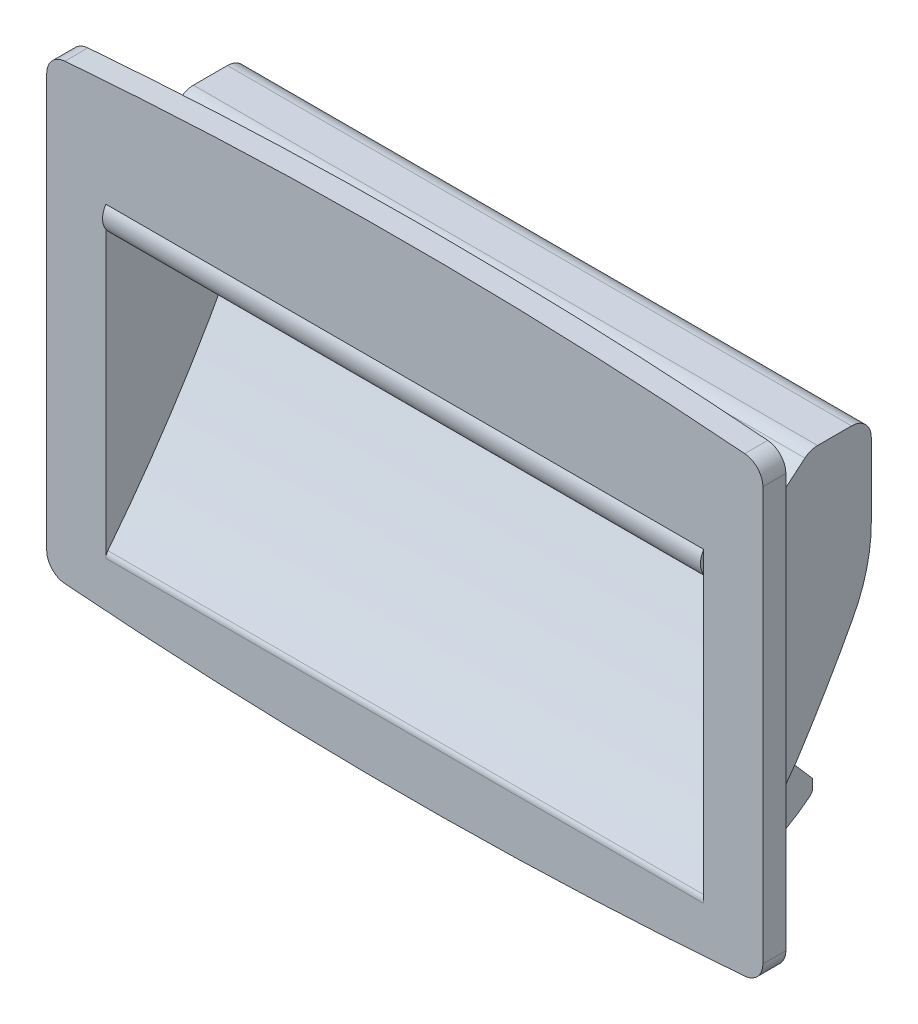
ISO-10303-21;
HEADER;
FILE_DESCRIPTION(('STEP AP214'),'2;1');
FILE_NAME('part.step','',(''),(''),'','','');
FILE_SCHEMA(('AUTOMOTIVE_DESIGN { 1 0 10303 214 1 1 1 1 }'));
ENDSEC;
DATA;
#1=APPLICATION_CONTEXT('core data for automotive mechanical design processes');
#2=APPLICATION_PROTOCOL_DEFINITION('international standard','automotive_design',2000,#1);
#3=PRODUCT_CONTEXT('',#1,'mechanical');
#4=PRODUCT('Part','Part','',(#3));
#5=PRODUCT_RELATED_PRODUCT_CATEGORY('part','',(#4));
#6=PRODUCT_DEFINITION_FORMATION('','',#4);
#7=PRODUCT_DEFINITION_CONTEXT('part definition',#1,'design');
#8=PRODUCT_DEFINITION('design','',#6,#7);
#9=PRODUCT_DEFINITION_SHAPE('','',#8);
#10=(LENGTH_UNIT() NAMED_UNIT(*) SI_UNIT(.MILLI.,.METRE.));
#11=(NAMED_UNIT(*) PLANE_ANGLE_UNIT() SI_UNIT($,.RADIAN.));
#12=(NAMED_UNIT(*) SI_UNIT($,.STERADIAN.) SOLID_ANGLE_UNIT());
#13=UNCERTAINTY_MEASURE_WITH_UNIT(LENGTH_MEASURE(1.E-05),#10,'distance_accuracy_value','');
#14=(GEOMETRIC_REPRESENTATION_CONTEXT(3) GLOBAL_UNCERTAINTY_ASSIGNED_CONTEXT((#13)) GLOBAL_UNIT_ASSIGNED_CONTEXT((#10,
#11,#12)) REPRESENTATION_CONTEXT('',''));
#15=CARTESIAN_POINT('',(0.,0.,0.));
#16=DIRECTION('',(0.,0.,1.));
#17=DIRECTION('',(1.,0.,0.));
#18=AXIS2_PLACEMENT_3D('',#15,#16,#17);
#19=CARTESIAN_POINT('',(27.,24.5,-15.0749870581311));
#20=DIRECTION('',(1.,0.,0.));
#21=DIRECTION('',(0.,0.,-1.));
#22=AXIS2_PLACEMENT_3D('',#19,#20,#21);
#23=PLANE('',#22);
#24=DIRECTION('',(0.,0.707108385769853,0.707105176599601));
#25=VECTOR('',#24,1.);
#26=CARTESIAN_POINT('',(27.,15.7953852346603,-6.37033278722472));
#27=LINE('',#26,#25);
#28=CARTESIAN_POINT('',(27.,18.5241331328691,-3.6415972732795));
#29=VERTEX_POINT('',#28);
#30=CARTESIAN_POINT('',(27.,18.6657310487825,-3.5));
#31=VERTEX_POINT('',#30);
#32=EDGE_CURVE('E801',#29,#31,#27,.T.);
#33=ORIENTED_EDGE('',*,*,#32,.F.);
#34=DIRECTION('',(0.,2.8369185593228E-06,0.999999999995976));
#35=VECTOR('',#34,1.);
#36=CARTESIAN_POINT('',(27.,18.5241006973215,-15.0749701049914));
#37=LINE('',#36,#35);
#38=CARTESIAN_POINT('',(27.,18.5241318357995,-4.09880800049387));
#39=VERTEX_POINT('',#38);
#40=EDGE_CURVE('E779',#39,#29,#37,.T.);
#41=ORIENTED_EDGE('',*,*,#40,.F.);
#42=DIRECTION('',(0.,-0.342011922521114,0.939695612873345));
#43=VECTOR('',#42,1.);
#44=CARTESIAN_POINT('',(27.,22.750744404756,-15.7116466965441));
#45=LINE('',#44,#43);
#46=CARTESIAN_POINT('',(27.,18.5943160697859,-4.29164284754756));
#47=VERTEX_POINT('',#46);
#48=EDGE_CURVE('E757',#47,#39,#45,.T.);
#49=ORIENTED_EDGE('',*,*,#48,.F.);
#50=DIRECTION('',(0.,-0.642787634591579,0.766044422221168));
#51=VECTOR('',#50,1.);
#52=CARTESIAN_POINT('',(27.,26.3441631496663,-13.5275503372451));
#53=LINE('',#52,#51);
#54=CARTESIAN_POINT('',(27.,22.451996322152,-8.88904684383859));
#55=VERTEX_POINT('',#54);
#56=EDGE_CURVE('E735',#55,#47,#53,.T.);
#57=ORIENTED_EDGE('',*,*,#56,.F.);
#58=CARTESIAN_POINT('',(27.,20.6441309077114,-10.4060261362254));
#59=DIRECTION('',(1.,0.,0.));
#60=DIRECTION('',(0.,0.,-1.));
#61=AXIS2_PLACEMENT_3D('',#58,#59,#60);
#62=CIRCLE('',#61,2.36000074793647);
#63=CARTESIAN_POINT('',(27.,23.0041316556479,-10.4060261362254));
#64=VERTEX_POINT('',#63);
#65=EDGE_CURVE('E712',#55,#64,#62,.F.);
#66=ORIENTED_EDGE('',*,*,#65,.T.);
#67=DIRECTION('',(0.,1.76066323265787E-11,1.));
#68=VECTOR('',#67,1.);
#69=CARTESIAN_POINT('',(27.,23.0041316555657,-15.0749870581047));
#70=LINE('',#69,#68);
#71=CARTESIAN_POINT('',(27.,23.0041316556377,-10.9853631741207));
#72=VERTEX_POINT('',#71);
#73=EDGE_CURVE('E680',#72,#64,#70,.T.);
#74=ORIENTED_EDGE('',*,*,#73,.F.);
#75=DIRECTION('',(0.,-0.642045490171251,0.766666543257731));
#76=VECTOR('',#75,1.);
#77=CARTESIAN_POINT('',(27.,25.0281312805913,-13.402221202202));
#78=LINE('',#77,#76);
#79=CARTESIAN_POINT('',(27.,16.7355084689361,-3.5));
#80=VERTEX_POINT('',#79);
#81=EDGE_CURVE('E1007',#72,#80,#78,.T.);
#82=ORIENTED_EDGE('',*,*,#81,.T.);
#83=DIRECTION('',(0.,-1.,0.));
#84=VECTOR('',#83,1.);
#85=CARTESIAN_POINT('',(27.,24.5,-3.5));
#86=LINE('',#85,#84);
#87=EDGE_CURVE('E823',#31,#80,#86,.T.);
#88=ORIENTED_EDGE('',*,*,#87,.F.);
#89=EDGE_LOOP('',(#33,#41,#49,#57,#66,#74,#82,#88));
#90=FACE_BOUND('',#89,.T.);
#91=ADVANCED_FACE('F14',(#90),#23,.F.);
#92=CARTESIAN_POINT('',(30.079797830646,24.5,-3.5));
#93=DIRECTION('',(-0.999935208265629,0.,0.0113832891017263));
#94=DIRECTION('',(0.0113832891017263,0.,0.999935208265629));
#95=AXIS2_PLACEMENT_3D('',#92,#93,#94);
#96=PLANE('',#95);
#97=DIRECTION('',(-0.00804944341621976,-0.707085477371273,-0.707082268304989));
#98=VECTOR('',#97,1.);
#99=CARTESIAN_POINT('',(30.1130044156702,21.5826897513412,-0.583054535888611));
#100=LINE('',#99,#98);
#101=CARTESIAN_POINT('',(30.079797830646,18.6657310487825,-3.5));
#102=VERTEX_POINT('',#101);
#103=CARTESIAN_POINT('',(30.0781858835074,18.5241331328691,-3.6415972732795));
#104=VERTEX_POINT('',#103);
#105=EDGE_CURVE('E799',#102,#104,#100,.T.);
#106=ORIENTED_EDGE('',*,*,#105,.F.);
#107=DIRECTION('',(0.,-1.,0.));
#108=VECTOR('',#107,1.);
#109=CARTESIAN_POINT('',(30.079797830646,24.5,-3.5));
#110=LINE('',#109,#108);
#111=CARTESIAN_POINT('',(30.079797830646,16.7355084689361,-3.5));
#112=VERTEX_POINT('',#111);
#113=EDGE_CURVE('E825',#102,#112,#110,.T.);
#114=ORIENTED_EDGE('',*,*,#113,.T.);
#115=DIRECTION('',(-0.00872741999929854,0.642021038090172,-0.766637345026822));
#116=VECTOR('',#115,1.);
#117=CARTESIAN_POINT('',(29.9684061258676,24.9298909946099,-13.2849124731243));
#118=LINE('',#117,#116);
#119=CARTESIAN_POINT('',(29.9945842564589,23.0041316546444,-10.9853631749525));
#120=VERTEX_POINT('',#119);
#121=EDGE_CURVE('E1010',#112,#120,#118,.T.);
#122=ORIENTED_EDGE('',*,*,#121,.T.);
#123=DIRECTION('',(-0.0113832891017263,-1.76054915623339E-11,-0.999935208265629));
#124=VECTOR('',#123,1.);
#125=CARTESIAN_POINT('',(30.0797978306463,23.0041316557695,-3.49999999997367));
#126=LINE('',#125,#124);
#127=CARTESIAN_POINT('',(30.0011794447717,23.0041316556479,-10.4060261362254));
#128=VERTEX_POINT('',#127);
#129=EDGE_CURVE('E677',#128,#120,#126,.T.);
#130=ORIENTED_EDGE('',*,*,#129,.F.);
#131=CARTESIAN_POINT('',(30.0011794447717,20.6441309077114,-10.4060261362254));
#132=DIRECTION('',(-0.999935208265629,0.,0.0113832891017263));
#133=DIRECTION('',(-0.0113832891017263,0.,-0.999935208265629));
#134=AXIS2_PLACEMENT_3D('',#131,#132,#133);
#135=ELLIPSE('',#134,2.36015366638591,2.36000074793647);
#136=CARTESIAN_POINT('',(30.0184487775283,22.451996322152,-8.88904684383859));
#137=VERTEX_POINT('',#136);
#138=EDGE_CURVE('E709',#128,#137,#135,.F.);
#139=ORIENTED_EDGE('',*,*,#138,.T.);
#140=DIRECTION('',(-0.00872033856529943,0.642763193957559,-0.766015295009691));
#141=VECTOR('',#140,1.);
#142=CARTESIAN_POINT('',(30.042972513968,20.6443881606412,-6.73482346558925));
#143=LINE('',#142,#141);
#144=CARTESIAN_POINT('',(30.0707857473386,18.5943160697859,-4.29164284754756));
#145=VERTEX_POINT('',#144);
#146=EDGE_CURVE('E733',#145,#137,#143,.T.);
#147=ORIENTED_EDGE('',*,*,#146,.F.);
#148=DIRECTION('',(-0.0106969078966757,0.341992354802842,-0.939641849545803));
#149=VECTOR('',#148,1.);
#150=CARTESIAN_POINT('',(30.0571392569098,19.030609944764,-5.49038304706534));
#151=LINE('',#150,#149);
#152=CARTESIAN_POINT('',(30.0729809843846,18.5241318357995,-4.09880800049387));
#153=VERTEX_POINT('',#152);
#154=EDGE_CURVE('E755',#153,#145,#151,.T.);
#155=ORIENTED_EDGE('',*,*,#154,.F.);
#156=DIRECTION('',(-0.0113832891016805,-2.83673475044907E-06,-0.999935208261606));
#157=VECTOR('',#156,1.);
#158=CARTESIAN_POINT('',(30.079798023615,18.5241335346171,-3.49998304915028));
#159=LINE('',#158,#157);
#160=EDGE_CURVE('E777',#104,#153,#159,.T.);
#161=ORIENTED_EDGE('',*,*,#160,.F.);
#162=EDGE_LOOP('',(#106,#114,#122,#130,#139,#147,#155,#161));
#163=FACE_BOUND('',#162,.T.);
#164=ADVANCED_FACE('F1105',(#163),#96,.F.);
#165=CARTESIAN_POINT('',(20.5541121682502,24.5,-15.0749870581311));
#166=DIRECTION('',(0.999935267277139,0.,0.0113781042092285));
#167=DIRECTION('',(0.0113781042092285,0.,-0.999935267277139));
#168=AXIS2_PLACEMENT_3D('',#165,#166,#167);
#169=PLANE('',#168);
#170=DIRECTION('',(-0.00804577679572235,0.707085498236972,0.707082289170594));
#171=VECTOR('',#170,1.);
#172=CARTESIAN_POINT('',(20.4550697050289,15.79482174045,-6.37089627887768));
#173=LINE('',#172,#171);
#174=CARTESIAN_POINT('',(20.4240134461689,18.5241331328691,-3.6415972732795));
#175=VERTEX_POINT('',#174);
#176=CARTESIAN_POINT('',(20.4224022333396,18.6657310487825,-3.5));
#177=VERTEX_POINT('',#176);
#178=EDGE_CURVE('E797',#175,#177,#173,.T.);
#179=ORIENTED_EDGE('',*,*,#178,.F.);
#180=DIRECTION('',(-0.0113781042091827,2.83673491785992E-06,0.999935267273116));
#181=VECTOR('',#180,1.);
#182=CARTESIAN_POINT('',(20.5541119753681,18.5241006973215,-15.0749701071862));
#183=LINE('',#182,#181);
#184=CARTESIAN_POINT('',(20.4292159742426,18.5241318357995,-4.09880800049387));
#185=VERTEX_POINT('',#184);
#186=EDGE_CURVE('E775',#185,#175,#183,.T.);
#187=ORIENTED_EDGE('',*,*,#186,.F.);
#188=DIRECTION('',(-0.010692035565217,-0.34199237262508,0.939641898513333));
#189=VECTOR('',#188,1.);
#190=CARTESIAN_POINT('',(20.5613557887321,22.750717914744,-15.7115739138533));
#191=LINE('',#190,#189);
#192=CARTESIAN_POINT('',(20.4314102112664,18.5943160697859,-4.29164284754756));
#193=VERTEX_POINT('',#192);
#194=EDGE_CURVE('E753',#193,#185,#191,.T.);
#195=ORIENTED_EDGE('',*,*,#194,.F.);
#196=DIRECTION('',(-0.0087163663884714,-0.642763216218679,0.76601532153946));
#197=VECTOR('',#196,1.);
#198=CARTESIAN_POINT('',(20.5365054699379,26.3442617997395,-13.5276679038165));
#199=LINE('',#198,#197);
#200=CARTESIAN_POINT('',(20.4837233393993,22.451996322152,-8.88904684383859));
#201=VERTEX_POINT('',#200);
#202=EDGE_CURVE('E731',#201,#193,#199,.T.);
#203=ORIENTED_EDGE('',*,*,#202,.F.);
#204=CARTESIAN_POINT('',(20.5009848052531,20.6441309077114,-10.4060261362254));
#205=DIRECTION('',(0.999935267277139,0.,0.0113781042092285));
#206=DIRECTION('',(-0.0113781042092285,0.,0.999935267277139));
#207=AXIS2_PLACEMENT_3D('',#204,#205,#206);
#208=ELLIPSE('',#207,2.36015352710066,2.36000074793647);
#209=CARTESIAN_POINT('',(20.5009848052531,23.0041316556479,-10.4060261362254));
#210=VERTEX_POINT('',#209);
#211=EDGE_CURVE('E706',#201,#210,#208,.F.);
#212=ORIENTED_EDGE('',*,*,#211,.T.);
#213=DIRECTION('',(-0.0113781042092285,1.76054926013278E-11,0.999935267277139));
#214=VECTOR('',#213,1.);
#215=CARTESIAN_POINT('',(20.5541121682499,23.0041316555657,-15.0749870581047));
#216=LINE('',#215,#214);
#217=CARTESIAN_POINT('',(20.5075769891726,23.0041316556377,-10.9853631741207));
#218=VERTEX_POINT('',#217);
#219=EDGE_CURVE('E675',#218,#210,#216,.T.);
#220=ORIENTED_EDGE('',*,*,#219,.F.);
#221=DIRECTION('',(-0.00872344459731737,-0.642021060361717,0.766637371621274));
#222=VECTOR('',#221,1.);
#223=CARTESIAN_POINT('',(20.5371300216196,25.179151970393,-13.5825550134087));
#224=LINE('',#223,#222);
#225=CARTESIAN_POINT('',(20.4224022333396,16.7355084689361,-3.5));
#226=VERTEX_POINT('',#225);
#227=EDGE_CURVE('E1013',#218,#226,#224,.T.);
#228=ORIENTED_EDGE('',*,*,#227,.T.);
#229=DIRECTION('',(0.,-1.,0.));
#230=VECTOR('',#229,1.);
#231=CARTESIAN_POINT('',(20.4224022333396,24.5,-3.5));
#232=LINE('',#231,#230);
#233=EDGE_CURVE('E819',#177,#226,#232,.T.);
#234=ORIENTED_EDGE('',*,*,#233,.F.);
#235=EDGE_LOOP('',(#179,#187,#195,#203,#212,#220,#228,#234));
#236=FACE_BOUND('',#235,.T.);
#237=ADVANCED_FACE('F1112',(#236),#169,.F.);
#238=CARTESIAN_POINT('',(23.5,24.5,-3.5));
#239=DIRECTION('',(-1.,0.,0.));
#240=DIRECTION('',(0.,0.,1.));
#241=AXIS2_PLACEMENT_3D('',#238,#239,#240);
#242=PLANE('',#241);
#243=DIRECTION('',(0.,-0.707108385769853,-0.707105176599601));
#244=VECTOR('',#243,1.);
#245=CARTESIAN_POINT('',(23.5,21.5828787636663,-0.582865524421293));
#246=LINE('',#245,#244);
#247=CARTESIAN_POINT('',(23.5,18.6657310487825,-3.5));
#248=VERTEX_POINT('',#247);
#249=CARTESIAN_POINT('',(23.5,18.5241331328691,-3.6415972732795));
#250=VERTEX_POINT('',#249);
#251=EDGE_CURVE('E795',#248,#250,#246,.T.);
#252=ORIENTED_EDGE('',*,*,#251,.F.);
#253=DIRECTION('',(0.,-1.,0.));
#254=VECTOR('',#253,1.);
#255=CARTESIAN_POINT('',(23.5,24.5,-3.5));
#256=LINE('',#255,#254);
#257=CARTESIAN_POINT('',(23.5,16.7355084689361,-3.5));
#258=VERTEX_POINT('',#257);
#259=EDGE_CURVE('E821',#248,#258,#256,.T.);
#260=ORIENTED_EDGE('',*,*,#259,.T.);
#261=DIRECTION('',(0.,0.642045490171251,-0.766666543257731));
#262=VECTOR('',#261,1.);
#263=CARTESIAN_POINT('',(23.5,25.0281312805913,-13.402221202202));
#264=LINE('',#263,#262);
#265=CARTESIAN_POINT('',(23.5,23.0041316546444,-10.9853631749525));
#266=VERTEX_POINT('',#265);
#267=EDGE_CURVE('E1016',#258,#266,#264,.T.);
#268=ORIENTED_EDGE('',*,*,#267,.T.);
#269=DIRECTION('',(0.,-1.76066323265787E-11,-1.));
#270=VECTOR('',#269,1.);
#271=CARTESIAN_POINT('',(23.5,23.0041316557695,-3.49999999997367));
#272=LINE('',#271,#270);
#273=CARTESIAN_POINT('',(23.5,23.0041316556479,-10.4060261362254));
#274=VERTEX_POINT('',#273);
#275=EDGE_CURVE('E672',#274,#266,#272,.T.);
#276=ORIENTED_EDGE('',*,*,#275,.F.);
#277=CARTESIAN_POINT('',(23.5,20.6441309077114,-10.4060261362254));
#278=DIRECTION('',(-1.,0.,0.));
#279=DIRECTION('',(0.,0.,1.));
#280=AXIS2_PLACEMENT_3D('',#277,#278,#279);
#281=CIRCLE('',#280,2.36000074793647);
#282=CARTESIAN_POINT('',(23.5,22.451996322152,-8.88904684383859));
#283=VERTEX_POINT('',#282);
#284=EDGE_CURVE('E703',#274,#283,#281,.F.);
#285=ORIENTED_EDGE('',*,*,#284,.T.);
#286=DIRECTION('',(0.,0.642787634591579,-0.766044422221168));
#287=VECTOR('',#286,1.);
#288=CARTESIAN_POINT('',(23.5,20.6445945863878,-6.73506947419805));
#289=LINE('',#288,#287);
#290=CARTESIAN_POINT('',(23.5,18.5943160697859,-4.29164284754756));
#291=VERTEX_POINT('',#290);
#292=EDGE_CURVE('E729',#291,#283,#289,.T.);
#293=ORIENTED_EDGE('',*,*,#292,.F.);
#294=DIRECTION('',(0.,0.342011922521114,-0.939695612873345));
#295=VECTOR('',#294,1.);
#296=CARTESIAN_POINT('',(23.5,19.03069284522,-5.49061082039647));
#297=LINE('',#296,#295);
#298=CARTESIAN_POINT('',(23.5,18.5241318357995,-4.09880800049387));
#299=VERTEX_POINT('',#298);
#300=EDGE_CURVE('E751',#299,#291,#297,.T.);
#301=ORIENTED_EDGE('',*,*,#300,.F.);
#302=DIRECTION('',(0.,-2.8369185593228E-06,-0.999999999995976));
#303=VECTOR('',#302,1.);
#304=CARTESIAN_POINT('',(23.5,18.5241335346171,-3.49998304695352));
#305=LINE('',#304,#303);
#306=EDGE_CURVE('E773',#250,#299,#305,.T.);
#307=ORIENTED_EDGE('',*,*,#306,.F.);
#308=EDGE_LOOP('',(#252,#260,#268,#276,#285,#293,#301,#307));
#309=FACE_BOUND('',#308,.T.);
#310=ADVANCED_FACE('F1117',(#309),#242,.F.);
#311=CARTESIAN_POINT('',(5.30588995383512,24.5,-15.0749870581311));
#312=DIRECTION('',(0.999935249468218,0.,0.0113796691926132));
#313=DIRECTION('',(0.0113796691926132,0.,-0.999935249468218));
#314=AXIS2_PLACEMENT_3D('',#311,#312,#313);
#315=PLANE('',#314);
#316=DIRECTION('',(-0.00804688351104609,0.70708549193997,0.70708228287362));
#317=VECTOR('',#316,1.);
#318=CARTESIAN_POINT('',(5.20683386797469,15.7948215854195,-6.37089643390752));
#319=LINE('',#318,#317);
#320=CARTESIAN_POINT('',(5.17577333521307,18.5241331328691,-3.6415972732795));
#321=VERTEX_POINT('',#320);
#322=CARTESIAN_POINT('',(5.17416190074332,18.6657310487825,-3.5));
#323=VERTEX_POINT('',#322);
#324=EDGE_CURVE('E793',#321,#323,#319,.T.);
#325=ORIENTED_EDGE('',*,*,#324,.F.);
#326=DIRECTION('',(-0.0113796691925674,2.83673486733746E-06,0.999935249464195));
#327=VECTOR('',#326,1.);
#328=CARTESIAN_POINT('',(5.30588976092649,18.5241006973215,-15.0749701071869));
#329=LINE('',#328,#327);
#330=CARTESIAN_POINT('',(5.18097657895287,18.5241318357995,-4.09880800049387));
#331=VERTEX_POINT('',#330);
#332=EDGE_CURVE('E771',#331,#321,#329,.T.);
#333=ORIENTED_EDGE('',*,*,#332,.F.);
#334=DIRECTION('',(-0.010693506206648,-0.341992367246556,0.939641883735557));
#335=VECTOR('',#334,1.);
#336=CARTESIAN_POINT('',(5.31313457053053,22.7507179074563,-15.7115738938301));
#337=LINE('',#336,#335);
#338=CARTESIAN_POINT('',(5.18317111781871,18.5943160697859,-4.29164284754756));
#339=VERTEX_POINT('',#338);
#340=EDGE_CURVE('E749',#339,#331,#337,.T.);
#341=ORIENTED_EDGE('',*,*,#340,.F.);
#342=DIRECTION('',(-0.00871756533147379,-0.642763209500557,0.766015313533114));
#343=VECTOR('',#342,1.);
#344=CARTESIAN_POINT('',(5.28828083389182,26.3442618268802,-13.5276679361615));
#345=LINE('',#344,#343);
#346=CARTESIAN_POINT('',(5.23549144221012,22.451996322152,-8.88904684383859));
#347=VERTEX_POINT('',#346);
#348=EDGE_CURVE('E727',#347,#339,#345,.T.);
#349=ORIENTED_EDGE('',*,*,#348,.F.);
#350=CARTESIAN_POINT('',(5.25275528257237,20.6441309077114,-10.4060261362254));
#351=DIRECTION('',(0.999935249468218,0.,0.0113796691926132));
#352=DIRECTION('',(-0.0113796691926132,0.,0.999935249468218));
#353=AXIS2_PLACEMENT_3D('',#350,#351,#352);
#354=ELLIPSE('',#353,2.36015356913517,2.36000074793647);
#355=CARTESIAN_POINT('',(5.25275528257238,23.0041316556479,-10.4060261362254));
#356=VERTEX_POINT('',#355);
#357=EDGE_CURVE('E700',#347,#356,#354,.F.);
#358=ORIENTED_EDGE('',*,*,#357,.T.);
#359=DIRECTION('',(-0.0113796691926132,1.76054922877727E-11,0.999935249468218));
#360=VECTOR('',#359,1.);
#361=CARTESIAN_POINT('',(5.30588995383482,23.0041316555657,-15.0749870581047));
#362=LINE('',#361,#360);
#363=CARTESIAN_POINT('',(5.25934837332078,23.0041316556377,-10.9853631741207));
#364=VERTEX_POINT('',#363);
#365=EDGE_CURVE('E670',#364,#356,#362,.T.);
#366=ORIENTED_EDGE('',*,*,#365,.F.);
#367=DIRECTION('',(-0.00872464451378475,-0.642021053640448,0.766637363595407));
#368=VECTOR('',#367,1.);
#369=CARTESIAN_POINT('',(5.29006643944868,25.2645842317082,-13.6845696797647));
#370=LINE('',#369,#368);
#371=CARTESIAN_POINT('',(5.17416190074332,16.7355084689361,-3.5));
#372=VERTEX_POINT('',#371);
#373=EDGE_CURVE('E1019',#364,#372,#370,.T.);
#374=ORIENTED_EDGE('',*,*,#373,.T.);
#375=DIRECTION('',(0.,-1.,0.));
#376=VECTOR('',#375,1.);
#377=CARTESIAN_POINT('',(5.17416190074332,24.5,-3.5));
#378=LINE('',#377,#376);
#379=EDGE_CURVE('E815',#323,#372,#378,.T.);
#380=ORIENTED_EDGE('',*,*,#379,.F.);
#381=EDGE_LOOP('',(#325,#333,#341,#349,#358,#366,#374,#380));
#382=FACE_BOUND('',#381,.T.);
#383=ADVANCED_FACE('F1548',(#382),#315,.F.);
#384=CARTESIAN_POINT('',(10.0761750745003,24.5,-3.5));
#385=DIRECTION('',(-0.999935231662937,0.,0.0113812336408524));
#386=DIRECTION('',(0.0113812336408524,0.,0.999935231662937));
#387=AXIS2_PLACEMENT_3D('',#384,#385,#386);
#388=PLANE('',#387);
#389=DIRECTION('',(-0.00804798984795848,-0.707085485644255,-0.707082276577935));
#390=VECTOR('',#389,1.);
#391=CARTESIAN_POINT('',(10.1093756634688,21.5826898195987,-0.583054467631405));
#392=LINE('',#391,#390);
#393=CARTESIAN_POINT('',(10.0761750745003,18.6657310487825,-3.5));
#394=VERTEX_POINT('',#393);
#395=CARTESIAN_POINT('',(10.0745634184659,18.5241331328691,-3.6415972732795));
#396=VERTEX_POINT('',#395);
#397=EDGE_CURVE('E791',#394,#396,#392,.T.);
#398=ORIENTED_EDGE('',*,*,#397,.F.);
#399=DIRECTION('',(0.,-1.,0.));
#400=VECTOR('',#399,1.);
#401=CARTESIAN_POINT('',(10.0761750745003,24.5,-3.5));
#402=LINE('',#401,#400);
#403=CARTESIAN_POINT('',(10.0761750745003,16.7355084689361,-3.5));
#404=VERTEX_POINT('',#403);
#405=EDGE_CURVE('E817',#394,#404,#402,.T.);
#406=ORIENTED_EDGE('',*,*,#405,.T.);
#407=DIRECTION('',(-0.00872584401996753,0.642021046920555,-0.766637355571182));
#408=VECTOR('',#407,1.);
#409=CARTESIAN_POINT('',(9.96632632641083,24.8178450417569,-13.1511183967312));
#410=LINE('',#409,#408);
#411=CARTESIAN_POINT('',(9.99097688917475,23.0041316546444,-10.9853631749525));
#412=VERTEX_POINT('',#411);
#413=EDGE_CURVE('E1022',#404,#412,#410,.T.);
#414=ORIENTED_EDGE('',*,*,#413,.T.);
#415=DIRECTION('',(-0.0113812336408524,-1.76054919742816E-11,-0.999935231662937));
#416=VECTOR('',#415,1.);
#417=CARTESIAN_POINT('',(10.0761750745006,23.0041316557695,-3.49999999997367));
#418=LINE('',#417,#416);
#419=CARTESIAN_POINT('',(9.99757088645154,23.0041316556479,-10.4060261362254));
#420=VERTEX_POINT('',#419);
#421=EDGE_CURVE('E667',#420,#412,#418,.T.);
#422=ORIENTED_EDGE('',*,*,#421,.F.);
#423=CARTESIAN_POINT('',(9.99757088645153,20.6441309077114,-10.4060261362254));
#424=DIRECTION('',(-0.999935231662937,0.,0.0113812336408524));
#425=DIRECTION('',(-0.0113812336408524,0.,-0.999935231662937));
#426=AXIS2_PLACEMENT_3D('',#423,#424,#425);
#427=ELLIPSE('',#426,2.36015361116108,2.36000074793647);
#428=CARTESIAN_POINT('',(10.0148371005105,22.451996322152,-8.88904684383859));
#429=VERTEX_POINT('',#428);
#430=EDGE_CURVE('E697',#420,#429,#427,.F.);
#431=ORIENTED_EDGE('',*,*,#430,.T.);
#432=DIRECTION('',(-0.0087187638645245,0.642763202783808,-0.766015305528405));
#433=VECTOR('',#432,1.);
#434=CARTESIAN_POINT('',(10.0393564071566,20.6443882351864,-6.73482355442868));
#435=LINE('',#434,#433);
#436=CARTESIAN_POINT('',(10.0671646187,18.5943160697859,-4.29164284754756));
#437=VERTEX_POINT('',#436);
#438=EDGE_CURVE('E725',#437,#429,#435,.T.);
#439=ORIENTED_EDGE('',*,*,#438,.F.);
#440=DIRECTION('',(-0.0106949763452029,0.341992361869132,-0.939641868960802));
#441=VECTOR('',#440,1.);
#442=CARTESIAN_POINT('',(10.0535205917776,19.0306099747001,-5.49038312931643));
#443=LINE('',#442,#441);
#444=CARTESIAN_POINT('',(10.0693594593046,18.5241318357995,-4.09880800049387));
#445=VERTEX_POINT('',#444);
#446=EDGE_CURVE('E747',#445,#437,#443,.T.);
#447=ORIENTED_EDGE('',*,*,#446,.F.);
#448=DIRECTION('',(-0.0113812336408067,-2.83673481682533E-06,-0.999935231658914));
#449=VECTOR('',#448,1.);
#450=CARTESIAN_POINT('',(10.0761752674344,18.5241335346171,-3.49998304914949));
#451=LINE('',#450,#449);
#452=EDGE_CURVE('E769',#396,#445,#451,.T.);
#453=ORIENTED_EDGE('',*,*,#452,.F.);
#454=EDGE_LOOP('',(#398,#406,#414,#422,#431,#439,#447,#453));
#455=FACE_BOUND('',#454,.T.);
#456=ADVANCED_FACE('F1552',(#455),#388,.F.);
#457=CARTESIAN_POINT('',(-9.94442890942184,24.5,-15.0749870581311));
#458=DIRECTION('',(0.999935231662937,0.,0.0113812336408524));
#459=DIRECTION('',(0.0113812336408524,0.,-0.999935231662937));
#460=AXIS2_PLACEMENT_3D('',#457,#458,#459);
#461=PLANE('',#460);
#462=DIRECTION('',(-0.00804798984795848,0.707085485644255,0.707082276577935));
#463=VECTOR('',#462,1.);
#464=CARTESIAN_POINT('',(-10.0434986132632,15.7948214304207,-6.37089658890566));
#465=LINE('',#464,#463);
#466=CARTESIAN_POINT('',(-10.0745634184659,18.5241331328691,-3.6415972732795));
#467=VERTEX_POINT('',#466);
#468=CARTESIAN_POINT('',(-10.0761750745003,18.6657310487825,-3.5));
#469=VERTEX_POINT('',#468);
#470=EDGE_CURVE('E789',#467,#469,#465,.T.);
#471=ORIENTED_EDGE('',*,*,#470,.F.);
#472=DIRECTION('',(-0.0113812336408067,2.83673481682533E-06,0.999935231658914));
#473=VECTOR('',#472,1.);
#474=CARTESIAN_POINT('',(-9.94442910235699,18.5241006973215,-15.0749701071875));
#475=LINE('',#474,#473);
#476=CARTESIAN_POINT('',(-10.0693594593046,18.5241318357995,-4.09880800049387));
#477=VERTEX_POINT('',#476);
#478=EDGE_CURVE('E767',#477,#467,#475,.T.);
#479=ORIENTED_EDGE('',*,*,#478,.F.);
#480=DIRECTION('',(-0.0106949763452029,-0.341992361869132,0.939641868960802));
#481=VECTOR('',#480,1.);
#482=CARTESIAN_POINT('',(-9.93718329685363,22.7507179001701,-15.7115738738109));
#483=LINE('',#482,#481);
#484=CARTESIAN_POINT('',(-10.0671646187,18.5943160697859,-4.29164284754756));
#485=VERTEX_POINT('',#484);
#486=EDGE_CURVE('E745',#485,#477,#483,.T.);
#487=ORIENTED_EDGE('',*,*,#486,.F.);
#488=DIRECTION('',(-0.0087187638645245,-0.642763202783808,0.766015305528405));
#489=VECTOR('',#488,1.);
#490=CARTESIAN_POINT('',(-9.96204045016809,26.3442618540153,-13.5276679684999));
#491=LINE('',#490,#489);
#492=CARTESIAN_POINT('',(-10.0148371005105,22.451996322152,-8.88904684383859));
#493=VERTEX_POINT('',#492);
#494=EDGE_CURVE('E723',#493,#485,#491,.T.);
#495=ORIENTED_EDGE('',*,*,#494,.F.);
#496=CARTESIAN_POINT('',(-9.99757088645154,20.6441309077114,-10.4060261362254));
#497=DIRECTION('',(0.999935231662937,0.,0.0113812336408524));
#498=DIRECTION('',(-0.0113812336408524,0.,0.999935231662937));
#499=AXIS2_PLACEMENT_3D('',#496,#497,#498);
#500=ELLIPSE('',#499,2.36015361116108,2.36000074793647);
#501=CARTESIAN_POINT('',(-9.99757088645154,23.0041316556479,-10.4060261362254));
#502=VERTEX_POINT('',#501);
#503=EDGE_CURVE('E694',#493,#502,#500,.F.);
#504=ORIENTED_EDGE('',*,*,#503,.T.);
#505=DIRECTION('',(-0.0113812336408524,1.76054919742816E-11,0.999935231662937));
#506=VECTOR('',#505,1.);
#507=CARTESIAN_POINT('',(-9.94442890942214,23.0041316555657,-15.0749870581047));
#508=LINE('',#507,#506);
#509=CARTESIAN_POINT('',(-9.99097688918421,23.0041316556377,-10.9853631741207));
#510=VERTEX_POINT('',#509);
#511=EDGE_CURVE('E665',#510,#502,#508,.T.);
#512=ORIENTED_EDGE('',*,*,#511,.F.);
#513=DIRECTION('',(-0.00872584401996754,-0.642021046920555,0.766637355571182));
#514=VECTOR('',#513,1.);
#515=CARTESIAN_POINT('',(-9.95909299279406,25.3500517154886,-13.7866264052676));
#516=LINE('',#515,#514);
#517=CARTESIAN_POINT('',(-10.0761750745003,16.7355084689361,-3.5));
#518=VERTEX_POINT('',#517);
#519=EDGE_CURVE('E1025',#510,#518,#516,.T.);
#520=ORIENTED_EDGE('',*,*,#519,.T.);
#521=DIRECTION('',(0.,-1.,0.));
#522=VECTOR('',#521,1.);
#523=CARTESIAN_POINT('',(-10.0761750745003,24.5,-3.5));
#524=LINE('',#523,#522);
#525=EDGE_CURVE('E811',#469,#518,#524,.T.);
#526=ORIENTED_EDGE('',*,*,#525,.F.);
#527=EDGE_LOOP('',(#471,#479,#487,#495,#504,#512,#520,#526));
#528=FACE_BOUND('',#527,.T.);
#529=ADVANCED_FACE('F1397',(#528),#461,.F.);
#530=CARTESIAN_POINT('',(-5.17416190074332,24.5,-3.5));
#531=DIRECTION('',(-0.999935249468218,0.,0.0113796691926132));
#532=DIRECTION('',(0.0113796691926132,0.,0.999935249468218));
#533=AXIS2_PLACEMENT_3D('',#530,#531,#532);
#534=PLANE('',#533);
#535=DIRECTION('',(-0.00804688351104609,-0.70708549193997,-0.70708228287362));
#536=VECTOR('',#535,1.);
#537=CARTESIAN_POINT('',(-5.14096587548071,21.5826898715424,-0.583054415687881));
#538=LINE('',#537,#536);
#539=CARTESIAN_POINT('',(-5.17416190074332,18.6657310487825,-3.5));
#540=VERTEX_POINT('',#539);
#541=CARTESIAN_POINT('',(-5.17577333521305,18.5241331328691,-3.6415972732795));
#542=VERTEX_POINT('',#541);
#543=EDGE_CURVE('E787',#540,#542,#538,.T.);
#544=ORIENTED_EDGE('',*,*,#543,.F.);
#545=DIRECTION('',(0.,-1.,0.));
#546=VECTOR('',#545,1.);
#547=CARTESIAN_POINT('',(-5.17416190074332,24.5,-3.5));
#548=LINE('',#547,#546);
#549=CARTESIAN_POINT('',(-5.17416190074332,16.7355084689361,-3.5));
#550=VERTEX_POINT('',#549);
#551=EDGE_CURVE('E813',#540,#550,#548,.T.);
#552=ORIENTED_EDGE('',*,*,#551,.T.);
#553=DIRECTION('',(-0.00872464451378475,0.642021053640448,-0.766637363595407));
#554=VECTOR('',#553,1.);
#555=CARTESIAN_POINT('',(-5.28283509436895,24.7324507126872,-13.0491490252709));
#556=LINE('',#555,#554);
#557=CARTESIAN_POINT('',(-5.25934837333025,23.0041316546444,-10.9853631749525));
#558=VERTEX_POINT('',#557);
#559=EDGE_CURVE('E1028',#550,#558,#556,.T.);
#560=ORIENTED_EDGE('',*,*,#559,.T.);
#561=DIRECTION('',(-0.0113796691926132,-1.76054922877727E-11,-0.999935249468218));
#562=VECTOR('',#561,1.);
#563=CARTESIAN_POINT('',(-5.17416190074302,23.0041316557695,-3.49999999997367));
#564=LINE('',#563,#562);
#565=CARTESIAN_POINT('',(-5.25275528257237,23.0041316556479,-10.4060261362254));
#566=VERTEX_POINT('',#565);
#567=EDGE_CURVE('E662',#566,#558,#564,.T.);
#568=ORIENTED_EDGE('',*,*,#567,.F.);
#569=CARTESIAN_POINT('',(-5.25275528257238,20.6441309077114,-10.4060261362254));
#570=DIRECTION('',(-0.999935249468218,0.,0.0113796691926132));
#571=DIRECTION('',(-0.0113796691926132,0.,-0.999935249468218));
#572=AXIS2_PLACEMENT_3D('',#569,#570,#571);
#573=ELLIPSE('',#572,2.36015356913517,2.36000074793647);
#574=CARTESIAN_POINT('',(-5.23549144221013,22.451996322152,-8.88904684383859));
#575=VERTEX_POINT('',#574);
#576=EDGE_CURVE('E691',#566,#575,#573,.F.);
#577=ORIENTED_EDGE('',*,*,#576,.T.);
#578=DIRECTION('',(-0.00871756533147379,0.642763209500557,-0.766015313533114));
#579=VECTOR('',#578,1.);
#580=CARTESIAN_POINT('',(-5.21097550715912,20.644388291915,-6.73482362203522));
#581=LINE('',#580,#579);
#582=CARTESIAN_POINT('',(-5.18317111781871,18.5943160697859,-4.29164284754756));
#583=VERTEX_POINT('',#582);
#584=EDGE_CURVE('E721',#583,#575,#581,.T.);
#585=ORIENTED_EDGE('',*,*,#584,.F.);
#586=DIRECTION('',(-0.0106935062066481,0.341992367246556,-0.939641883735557));
#587=VECTOR('',#586,1.);
#588=CARTESIAN_POINT('',(-5.19681326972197,19.0306099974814,-5.49038319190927));
#589=LINE('',#588,#587);
#590=CARTESIAN_POINT('',(-5.18097657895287,18.5241318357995,-4.09880800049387));
#591=VERTEX_POINT('',#590);
#592=EDGE_CURVE('E743',#591,#583,#589,.T.);
#593=ORIENTED_EDGE('',*,*,#592,.F.);
#594=DIRECTION('',(-0.0113796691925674,-2.83673486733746E-06,-0.999935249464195));
#595=VECTOR('',#594,1.);
#596=CARTESIAN_POINT('',(-5.17416170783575,18.5241335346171,-3.49998304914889));
#597=LINE('',#596,#595);
#598=EDGE_CURVE('E765',#542,#591,#597,.T.);
#599=ORIENTED_EDGE('',*,*,#598,.F.);
#600=EDGE_LOOP('',(#544,#552,#560,#568,#577,#585,#593,#599));
#601=FACE_BOUND('',#600,.T.);
#602=ADVANCED_FACE('F1402',(#601),#534,.F.);
#603=CARTESIAN_POINT('',(-23.5,24.5,-15.0749870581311));
#604=DIRECTION('',(1.,0.,0.));
#605=DIRECTION('',(0.,0.,-1.));
#606=AXIS2_PLACEMENT_3D('',#603,#604,#605);
#607=PLANE('',#606);
#608=DIRECTION('',(0.,0.707108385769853,0.707105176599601));
#609=VECTOR('',#608,1.);
#610=CARTESIAN_POINT('',(-23.5,15.7953852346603,-6.37033278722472));
#611=LINE('',#610,#609);
#612=CARTESIAN_POINT('',(-23.5,18.5241331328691,-3.6415972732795));
#613=VERTEX_POINT('',#612);
#614=CARTESIAN_POINT('',(-23.5,18.6657310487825,-3.5));
#615=VERTEX_POINT('',#614);
#616=EDGE_CURVE('E785',#613,#615,#611,.T.);
#617=ORIENTED_EDGE('',*,*,#616,.F.);
#618=DIRECTION('',(0.,2.8369185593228E-06,0.999999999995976));
#619=VECTOR('',#618,1.);
#620=CARTESIAN_POINT('',(-23.5,18.5241006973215,-15.0749701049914));
#621=LINE('',#620,#619);
#622=CARTESIAN_POINT('',(-23.5,18.5241318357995,-4.09880800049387));
#623=VERTEX_POINT('',#622);
#624=EDGE_CURVE('E763',#623,#613,#621,.T.);
#625=ORIENTED_EDGE('',*,*,#624,.F.);
#626=DIRECTION('',(0.,-0.342011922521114,0.939695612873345));
#627=VECTOR('',#626,1.);
#628=CARTESIAN_POINT('',(-23.5,22.750744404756,-15.7116466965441));
#629=LINE('',#628,#627);
#630=CARTESIAN_POINT('',(-23.5,18.5943160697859,-4.29164284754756));
#631=VERTEX_POINT('',#630);
#632=EDGE_CURVE('E741',#631,#623,#629,.T.);
#633=ORIENTED_EDGE('',*,*,#632,.F.);
#634=DIRECTION('',(0.,-0.642787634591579,0.766044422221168));
#635=VECTOR('',#634,1.);
#636=CARTESIAN_POINT('',(-23.5,26.3441631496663,-13.5275503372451));
#637=LINE('',#636,#635);
#638=CARTESIAN_POINT('',(-23.5,22.451996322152,-8.88904684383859));
#639=VERTEX_POINT('',#638);
#640=EDGE_CURVE('E719',#639,#631,#637,.T.);
#641=ORIENTED_EDGE('',*,*,#640,.F.);
#642=CARTESIAN_POINT('',(-23.5,20.6441309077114,-10.4060261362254));
#643=DIRECTION('',(1.,0.,0.));
#644=DIRECTION('',(0.,0.,-1.));
#645=AXIS2_PLACEMENT_3D('',#642,#643,#644);
#646=CIRCLE('',#645,2.36000074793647);
#647=CARTESIAN_POINT('',(-23.5,23.0041316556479,-10.4060261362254));
#648=VERTEX_POINT('',#647);
#649=EDGE_CURVE('E688',#639,#648,#646,.F.);
#650=ORIENTED_EDGE('',*,*,#649,.T.);
#651=DIRECTION('',(0.,1.76066323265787E-11,1.));
#652=VECTOR('',#651,1.);
#653=CARTESIAN_POINT('',(-23.5,23.0041316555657,-15.0749870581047));
#654=LINE('',#653,#652);
#655=CARTESIAN_POINT('',(-23.5,23.0041316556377,-10.9853631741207));
#656=VERTEX_POINT('',#655);
#657=EDGE_CURVE('E660',#656,#648,#654,.T.);
#658=ORIENTED_EDGE('',*,*,#657,.F.);
#659=DIRECTION('',(0.,-0.642045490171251,0.766666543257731));
#660=VECTOR('',#659,1.);
#661=CARTESIAN_POINT('',(-23.5,25.0281312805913,-13.402221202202));
#662=LINE('',#661,#660);
#663=CARTESIAN_POINT('',(-23.5,16.7355084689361,-3.5));
#664=VERTEX_POINT('',#663);
#665=EDGE_CURVE('E1031',#656,#664,#662,.T.);
#666=ORIENTED_EDGE('',*,*,#665,.T.);
#667=DIRECTION('',(0.,-1.,0.));
#668=VECTOR('',#667,1.);
#669=CARTESIAN_POINT('',(-23.5,24.5,-3.5));
#670=LINE('',#669,#668);
#671=EDGE_CURVE('E807',#615,#664,#670,.T.);
#672=ORIENTED_EDGE('',*,*,#671,.F.);
#673=EDGE_LOOP('',(#617,#625,#633,#641,#650,#658,#666,#672));
#674=FACE_BOUND('',#673,.T.);
#675=ADVANCED_FACE('F1239',(#674),#607,.F.);
#676=CARTESIAN_POINT('',(-20.4224022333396,24.5,-3.5));
#677=DIRECTION('',(-0.999935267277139,0.,0.0113781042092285));
#678=DIRECTION('',(0.0113781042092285,0.,0.999935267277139));
#679=AXIS2_PLACEMENT_3D('',#676,#677,#678);
#680=PLANE('',#679);
#681=DIRECTION('',(-0.00804577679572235,-0.707085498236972,-0.707082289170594));
#682=VECTOR('',#681,1.);
#683=CARTESIAN_POINT('',(-20.389210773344,21.5826899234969,-0.583054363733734));
#684=LINE('',#683,#682);
#685=CARTESIAN_POINT('',(-20.4224022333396,18.6657310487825,-3.5));
#686=VERTEX_POINT('',#685);
#687=CARTESIAN_POINT('',(-20.4240134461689,18.5241331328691,-3.6415972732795));
#688=VERTEX_POINT('',#687);
#689=EDGE_CURVE('E783',#686,#688,#684,.T.);
#690=ORIENTED_EDGE('',*,*,#689,.F.);
#691=DIRECTION('',(0.,-1.,0.));
#692=VECTOR('',#691,1.);
#693=CARTESIAN_POINT('',(-20.4224022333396,24.5,-3.5));
#694=LINE('',#693,#692);
#695=CARTESIAN_POINT('',(-20.4224022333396,16.7355084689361,-3.5));
#696=VERTEX_POINT('',#695);
#697=EDGE_CURVE('E809',#686,#696,#694,.T.);
#698=ORIENTED_EDGE('',*,*,#697,.T.);
#699=DIRECTION('',(-0.00872344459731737,0.642021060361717,-0.766637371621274));
#700=VECTOR('',#699,1.);
#701=CARTESIAN_POINT('',(-20.5299006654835,24.6470916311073,-12.9472217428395));
#702=LINE('',#701,#700);
#703=CARTESIAN_POINT('',(-20.507576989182,23.0041316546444,-10.9853631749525));
#704=VERTEX_POINT('',#703);
#705=EDGE_CURVE('E1034',#696,#704,#702,.T.);
#706=ORIENTED_EDGE('',*,*,#705,.T.);
#707=DIRECTION('',(-0.0113781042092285,-1.76054926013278E-11,-0.999935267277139));
#708=VECTOR('',#707,1.);
#709=CARTESIAN_POINT('',(-20.4224022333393,23.0041316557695,-3.49999999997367));
#710=LINE('',#709,#708);
#711=CARTESIAN_POINT('',(-20.5009848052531,23.0041316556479,-10.4060261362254));
#712=VERTEX_POINT('',#711);
#713=EDGE_CURVE('E657',#712,#704,#710,.T.);
#714=ORIENTED_EDGE('',*,*,#713,.F.);
#715=CARTESIAN_POINT('',(-20.5009848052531,20.6441309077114,-10.4060261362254));
#716=DIRECTION('',(-0.999935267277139,0.,0.0113781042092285));
#717=DIRECTION('',(-0.0113781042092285,0.,-0.999935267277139));
#718=AXIS2_PLACEMENT_3D('',#715,#716,#717);
#719=ELLIPSE('',#718,2.36015352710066,2.36000074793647);
#720=CARTESIAN_POINT('',(-20.4837233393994,22.451996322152,-8.88904684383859));
#721=VERTEX_POINT('',#720);
#722=EDGE_CURVE('E685',#712,#721,#719,.F.);
#723=ORIENTED_EDGE('',*,*,#722,.T.);
#724=DIRECTION('',(-0.0087163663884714,0.642763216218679,-0.76601532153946));
#725=VECTOR('',#724,1.);
#726=CARTESIAN_POINT('',(-20.4592107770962,20.6443883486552,-6.73482368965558));
#727=LINE('',#726,#725);
#728=CARTESIAN_POINT('',(-20.4314102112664,18.5943160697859,-4.29164284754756));
#729=VERTEX_POINT('',#728);
#730=EDGE_CURVE('E717',#729,#721,#727,.T.);
#731=ORIENTED_EDGE('',*,*,#730,.F.);
#732=DIRECTION('',(-0.010692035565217,0.34199237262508,-0.939641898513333));
#733=VECTOR('',#732,1.);
#734=CARTESIAN_POINT('',(-20.445050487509,19.0306100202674,-5.4903832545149));
#735=LINE('',#734,#733);
#736=CARTESIAN_POINT('',(-20.4292159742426,18.5241318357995,-4.09880800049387));
#737=VERTEX_POINT('',#736);
#738=EDGE_CURVE('E739',#737,#729,#735,.T.);
#739=ORIENTED_EDGE('',*,*,#738,.F.);
#740=DIRECTION('',(-0.0113781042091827,-2.83673491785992E-06,-0.999935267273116));
#741=VECTOR('',#740,1.);
#742=CARTESIAN_POINT('',(-20.4224020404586,18.5241335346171,-3.49998304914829));
#743=LINE('',#742,#741);
#744=EDGE_CURVE('E761',#688,#737,#743,.T.);
#745=ORIENTED_EDGE('',*,*,#744,.F.);
#746=EDGE_LOOP('',(#690,#698,#706,#714,#723,#731,#739,#745));
#747=FACE_BOUND('',#746,.T.);
#748=ADVANCED_FACE('F1418',(#747),#680,.F.);
#749=CARTESIAN_POINT('',(-27.,24.5,-3.5));
#750=DIRECTION('',(-1.,0.,0.));
#751=DIRECTION('',(0.,0.,1.));
#752=AXIS2_PLACEMENT_3D('',#749,#750,#751);
#753=PLANE('',#752);
#754=DIRECTION('',(0.,-0.707108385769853,-0.707105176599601));
#755=VECTOR('',#754,1.);
#756=CARTESIAN_POINT('',(-27.,21.5828787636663,-0.582865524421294));
#757=LINE('',#756,#755);
#758=CARTESIAN_POINT('',(-27.,18.6657310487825,-3.5));
#759=VERTEX_POINT('',#758);
#760=CARTESIAN_POINT('',(-27.,18.5241331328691,-3.6415972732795));
#761=VERTEX_POINT('',#760);
#762=EDGE_CURVE('E781',#759,#761,#757,.T.);
#763=ORIENTED_EDGE('',*,*,#762,.F.);
#764=DIRECTION('',(0.,-1.,0.));
#765=VECTOR('',#764,1.);
#766=CARTESIAN_POINT('',(-27.,24.5,-3.5));
#767=LINE('',#766,#765);
#768=CARTESIAN_POINT('',(-27.,16.7355084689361,-3.5));
#769=VERTEX_POINT('',#768);
#770=EDGE_CURVE('E805',#759,#769,#767,.T.);
#771=ORIENTED_EDGE('',*,*,#770,.T.);
#772=DIRECTION('',(0.,0.642045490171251,-0.766666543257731));
#773=VECTOR('',#772,1.);
#774=CARTESIAN_POINT('',(-27.,25.0281312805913,-13.402221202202));
#775=LINE('',#774,#773);
#776=CARTESIAN_POINT('',(-27.,23.0041316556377,-10.9853631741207));
#777=VERTEX_POINT('',#776);
#778=EDGE_CURVE('E1040',#769,#777,#775,.T.);
#779=ORIENTED_EDGE('',*,*,#778,.T.);
#780=DIRECTION('',(0.,-1.76066323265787E-11,-1.));
#781=VECTOR('',#780,1.);
#782=CARTESIAN_POINT('',(-27.,23.0041316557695,-3.49999999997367));
#783=LINE('',#782,#781);
#784=CARTESIAN_POINT('',(-27.,23.0041316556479,-10.4060261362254));
#785=VERTEX_POINT('',#784);
#786=EDGE_CURVE('E655',#785,#777,#783,.T.);
#787=ORIENTED_EDGE('',*,*,#786,.F.);
#788=CARTESIAN_POINT('',(-27.,20.6441309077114,-10.4060261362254));
#789=DIRECTION('',(-1.,0.,0.));
#790=DIRECTION('',(0.,0.,1.));
#791=AXIS2_PLACEMENT_3D('',#788,#789,#790);
#792=CIRCLE('',#791,2.36000074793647);
#793=CARTESIAN_POINT('',(-27.,22.451996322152,-8.88904684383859));
#794=VERTEX_POINT('',#793);
#795=EDGE_CURVE('E682',#785,#794,#792,.F.);
#796=ORIENTED_EDGE('',*,*,#795,.T.);
#797=DIRECTION('',(0.,0.642787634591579,-0.766044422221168));
#798=VECTOR('',#797,1.);
#799=CARTESIAN_POINT('',(-27.,20.6445945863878,-6.73506947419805));
#800=LINE('',#799,#798);
#801=CARTESIAN_POINT('',(-27.,18.5943160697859,-4.29164284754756));
#802=VERTEX_POINT('',#801);
#803=EDGE_CURVE('E715',#802,#794,#800,.T.);
#804=ORIENTED_EDGE('',*,*,#803,.F.);
#805=DIRECTION('',(0.,0.342011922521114,-0.939695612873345));
#806=VECTOR('',#805,1.);
#807=CARTESIAN_POINT('',(-27.,19.03069284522,-5.49061082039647));
#808=LINE('',#807,#806);
#809=CARTESIAN_POINT('',(-27.,18.5241318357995,-4.09880800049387));
#810=VERTEX_POINT('',#809);
#811=EDGE_CURVE('E737',#810,#802,#808,.T.);
#812=ORIENTED_EDGE('',*,*,#811,.F.);
#813=DIRECTION('',(0.,-2.8369185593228E-06,-0.999999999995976));
#814=VECTOR('',#813,1.);
#815=CARTESIAN_POINT('',(-27.,18.5241335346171,-3.49998304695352));
#816=LINE('',#815,#814);
#817=EDGE_CURVE('E759',#761,#810,#816,.T.);
#818=ORIENTED_EDGE('',*,*,#817,.F.);
#819=EDGE_LOOP('',(#763,#771,#779,#787,#796,#804,#812,#818));
#820=FACE_BOUND('',#819,.T.);
#821=ADVANCED_FACE('F1190',(#820),#753,.F.);
#822=CARTESIAN_POINT('',(-29.9480278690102,24.5,-15.0749870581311));
#823=DIRECTION('',(0.999935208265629,0.,0.0113832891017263));
#824=DIRECTION('',(0.0113832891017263,0.,-0.999935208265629));
#825=AXIS2_PLACEMENT_3D('',#822,#823,#824);
#826=PLANE('',#825);
#827=DIRECTION('',(-0.00804944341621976,0.707085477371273,0.707082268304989));
#828=VECTOR('',#827,1.);
#829=CARTESIAN_POINT('',(-30.0471154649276,15.794821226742,-6.37089679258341));
#830=LINE('',#829,#828);
#831=CARTESIAN_POINT('',(-30.0781858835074,18.5241331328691,-3.6415972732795));
#832=VERTEX_POINT('',#831);
#833=CARTESIAN_POINT('',(-30.079797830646,18.6657310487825,-3.5));
#834=VERTEX_POINT('',#833);
#835=EDGE_CURVE('E1054',#832,#834,#830,.T.);
#836=ORIENTED_EDGE('',*,*,#835,.F.);
#837=DIRECTION('',(-0.0113832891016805,2.83673475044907E-06,0.999935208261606));
#838=VECTOR('',#837,1.);
#839=CARTESIAN_POINT('',(-29.9480280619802,18.5241006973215,-15.0749701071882));
#840=LINE('',#839,#838);
#841=CARTESIAN_POINT('',(-30.0729809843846,18.5241318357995,-4.09880800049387));
#842=VERTEX_POINT('',#841);
#843=EDGE_CURVE('E1052',#842,#832,#840,.T.);
#844=ORIENTED_EDGE('',*,*,#843,.F.);
#845=DIRECTION('',(-0.0106969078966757,-0.341992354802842,0.939641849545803));
#846=VECTOR('',#845,1.);
#847=CARTESIAN_POINT('',(-29.9407809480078,22.7507178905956,-15.7115738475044));
#848=LINE('',#847,#846);
#849=CARTESIAN_POINT('',(-30.0707857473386,18.5943160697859,-4.29164284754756));
#850=VERTEX_POINT('',#849);
#851=EDGE_CURVE('E1050',#850,#842,#848,.T.);
#852=ORIENTED_EDGE('',*,*,#851,.F.);
#853=DIRECTION('',(-0.00872033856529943,-0.642763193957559,0.766015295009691));
#854=VECTOR('',#853,1.);
#855=CARTESIAN_POINT('',(-29.9656425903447,26.3442618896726,-13.5276680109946));
#856=LINE('',#855,#854);
#857=CARTESIAN_POINT('',(-30.0184487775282,22.451996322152,-8.88904684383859));
#858=VERTEX_POINT('',#857);
#859=EDGE_CURVE('E1048',#858,#850,#856,.T.);
#860=ORIENTED_EDGE('',*,*,#859,.F.);
#861=CARTESIAN_POINT('',(-30.0011794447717,20.6441309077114,-10.4060261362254));
#862=DIRECTION('',(0.999935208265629,0.,0.0113832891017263));
#863=DIRECTION('',(-0.0113832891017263,0.,0.999935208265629));
#864=AXIS2_PLACEMENT_3D('',#861,#862,#863);
#865=ELLIPSE('',#864,2.36015366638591,2.36000074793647);
#866=CARTESIAN_POINT('',(-30.0011794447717,23.0041316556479,-10.4060261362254));
#867=VERTEX_POINT('',#866);
#868=EDGE_CURVE('E1045',#858,#867,#865,.F.);
#869=ORIENTED_EDGE('',*,*,#868,.T.);
#870=DIRECTION('',(-0.0113832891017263,1.76054915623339E-11,0.999935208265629));
#871=VECTOR('',#870,1.);
#872=CARTESIAN_POINT('',(-29.9480278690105,23.0041316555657,-15.0749870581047));
#873=LINE('',#872,#871);
#874=CARTESIAN_POINT('',(-29.9945842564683,23.0041316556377,-10.9853631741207));
#875=VERTEX_POINT('',#874);
#876=EDGE_CURVE('E1043',#875,#867,#873,.T.);
#877=ORIENTED_EDGE('',*,*,#876,.F.);
#878=DIRECTION('',(-0.00872741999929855,-0.642021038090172,0.766637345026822));
#879=VECTOR('',#878,1.);
#880=CARTESIAN_POINT('',(-29.9611701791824,25.4621937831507,-13.9205352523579));
#881=LINE('',#880,#879);
#882=CARTESIAN_POINT('',(-30.079797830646,16.7355084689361,-3.5));
#883=VERTEX_POINT('',#882);
#884=EDGE_CURVE('E1037',#875,#883,#881,.T.);
#885=ORIENTED_EDGE('',*,*,#884,.T.);
#886=DIRECTION('',(0.,-1.,0.));
#887=VECTOR('',#886,1.);
#888=CARTESIAN_POINT('',(-30.079797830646,24.5,-3.5));
#889=LINE('',#888,#887);
#890=EDGE_CURVE('E803',#834,#883,#889,.T.);
#891=ORIENTED_EDGE('',*,*,#890,.F.);
#892=EDGE_LOOP('',(#836,#844,#852,#860,#869,#877,#885,#891));
#893=FACE_BOUND('',#892,.T.);
#894=ADVANCED_FACE('F1184',(#893),#826,.F.);
#895=CARTESIAN_POINT('',(-51.5,-31.4470908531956,-3.5));
#896=DIRECTION('',(0.,0.,1.));
#897=DIRECTION('',(1.,0.,0.));
#898=AXIS2_PLACEMENT_3D('',#895,#896,#897);
#899=PLANE('',#898);
#900=ORIENTED_EDGE('',*,*,#113,.F.);
#901=DIRECTION('',(-1.,0.,0.));
#902=VECTOR('',#901,1.);
#903=CARTESIAN_POINT('',(50.,18.6657310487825,-3.5));
#904=LINE('',#903,#902);
#905=EDGE_CURVE('E654',#102,#31,#904,.T.);
#906=ORIENTED_EDGE('',*,*,#905,.T.);
#907=ORIENTED_EDGE('',*,*,#87,.T.);
#908=DIRECTION('',(-1.,0.,0.));
#909=VECTOR('',#908,1.);
#910=CARTESIAN_POINT('',(47.5,16.7355084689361,-3.5));
#911=LINE('',#910,#909);
#912=EDGE_CURVE('E909',#80,#258,#911,.T.);
#913=ORIENTED_EDGE('',*,*,#912,.T.);
#914=ORIENTED_EDGE('',*,*,#259,.F.);
#915=EDGE_CURVE('E1255',#248,#177,#904,.T.);
#916=ORIENTED_EDGE('',*,*,#915,.T.);
#917=ORIENTED_EDGE('',*,*,#233,.T.);
#918=EDGE_CURVE('E1270',#226,#404,#911,.T.);
#919=ORIENTED_EDGE('',*,*,#918,.T.);
#920=ORIENTED_EDGE('',*,*,#405,.F.);
#921=EDGE_CURVE('E1251',#394,#323,#904,.T.);
#922=ORIENTED_EDGE('',*,*,#921,.T.);
#923=ORIENTED_EDGE('',*,*,#379,.T.);
#924=EDGE_CURVE('E1271',#372,#550,#911,.T.);
#925=ORIENTED_EDGE('',*,*,#924,.T.);
#926=ORIENTED_EDGE('',*,*,#551,.F.);
#927=EDGE_CURVE('E1249',#540,#469,#904,.T.);
#928=ORIENTED_EDGE('',*,*,#927,.T.);
#929=ORIENTED_EDGE('',*,*,#525,.T.);
#930=EDGE_CURVE('E1273',#518,#696,#911,.T.);
#931=ORIENTED_EDGE('',*,*,#930,.T.);
#932=ORIENTED_EDGE('',*,*,#697,.F.);
#933=EDGE_CURVE('E653',#686,#615,#904,.T.);
#934=ORIENTED_EDGE('',*,*,#933,.T.);
#935=ORIENTED_EDGE('',*,*,#671,.T.);
#936=EDGE_CURVE('E1246',#664,#769,#911,.T.);
#937=ORIENTED_EDGE('',*,*,#936,.T.);
#938=ORIENTED_EDGE('',*,*,#770,.F.);
#939=EDGE_CURVE('E650',#759,#834,#904,.T.);
#940=ORIENTED_EDGE('',*,*,#939,.T.);
#941=ORIENTED_EDGE('',*,*,#890,.T.);
#942=CARTESIAN_POINT('',(-47.5,16.7355084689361,-3.5));
#943=VERTEX_POINT('',#942);
#944=EDGE_CURVE('E885',#883,#943,#911,.T.);
#945=ORIENTED_EDGE('',*,*,#944,.T.);
#946=DIRECTION('',(0.,-1.,0.));
#947=VECTOR('',#946,1.);
#948=CARTESIAN_POINT('',(-47.5,16.7355084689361,-3.5));
#949=LINE('',#948,#947);
#950=CARTESIAN_POINT('',(-47.5,-26.194495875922,-3.5));
#951=VERTEX_POINT('',#950);
#952=EDGE_CURVE('E862',#943,#951,#949,.T.);
#953=ORIENTED_EDGE('',*,*,#952,.T.);
#954=DIRECTION('',(-1.,0.,0.));
#955=VECTOR('',#954,1.);
#956=CARTESIAN_POINT('',(47.5,-26.194495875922,-3.5));
#957=LINE('',#956,#955);
#958=CARTESIAN_POINT('',(-43.25,-26.194495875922,-3.5));
#959=VERTEX_POINT('',#958);
#960=EDGE_CURVE('E933',#959,#951,#957,.T.);
#961=ORIENTED_EDGE('',*,*,#960,.F.);
#962=DIRECTION('',(0.,-1.,0.));
#963=VECTOR('',#962,1.);
#964=CARTESIAN_POINT('',(-43.25,-4.41578068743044,-3.5));
#965=LINE('',#964,#963);
#966=CARTESIAN_POINT('',(-43.25,-30.1958569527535,-3.5));
#967=VERTEX_POINT('',#966);
#968=EDGE_CURVE('E827',#959,#967,#965,.T.);
#969=ORIENTED_EDGE('',*,*,#968,.T.);
#970=DIRECTION('',(-1.,0.,0.));
#971=VECTOR('',#970,1.);
#972=CARTESIAN_POINT('',(43.25,-30.1958569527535,-3.5));
#973=LINE('',#972,#971);
#974=CARTESIAN_POINT('',(43.25,-30.1958569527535,-3.5));
#975=VERTEX_POINT('',#974);
#976=EDGE_CURVE('E859',#975,#967,#973,.T.);
#977=ORIENTED_EDGE('',*,*,#976,.F.);
#978=DIRECTION('',(0.,-1.,0.));
#979=VECTOR('',#978,1.);
#980=CARTESIAN_POINT('',(43.25,-4.41578068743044,-3.5));
#981=LINE('',#980,#979);
#982=CARTESIAN_POINT('',(43.25,-26.194495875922,-3.5));
#983=VERTEX_POINT('',#982);
#984=EDGE_CURVE('E828',#983,#975,#981,.T.);
#985=ORIENTED_EDGE('',*,*,#984,.F.);
#986=CARTESIAN_POINT('',(47.5,-26.1944958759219,-3.5));
#987=VERTEX_POINT('',#986);
#988=EDGE_CURVE('E934',#987,#983,#957,.T.);
#989=ORIENTED_EDGE('',*,*,#988,.F.);
#990=DIRECTION('',(0.,-1.,0.));
#991=VECTOR('',#990,1.);
#992=CARTESIAN_POINT('',(47.5,16.7355084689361,-3.5));
#993=LINE('',#992,#991);
#994=CARTESIAN_POINT('',(47.5,16.7355084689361,-3.5));
#995=VERTEX_POINT('',#994);
#996=EDGE_CURVE('E863',#995,#987,#993,.T.);
#997=ORIENTED_EDGE('',*,*,#996,.F.);
#998=EDGE_CURVE('E905',#995,#112,#911,.T.);
#999=ORIENTED_EDGE('',*,*,#998,.T.);
#1000=EDGE_LOOP('',(#900,#906,#907,#913,#914,#916,#917,#919,#920,#922,#923,#925,#926,#928,#929,
#931,#932,#934,#935,#937,#938,#940,#941,#945,#953,#961,#969,#977,#985,#989,#997,#999));
#1001=FACE_BOUND('',#1000,.T.);
#1002=CARTESIAN_POINT('',(0.,-613.5,-3.5));
#1003=DIRECTION('',(0.,0.,1.));
#1004=DIRECTION('',(1.,0.,0.));
#1005=AXIS2_PLACEMENT_3D('',#1002,#1003,#1004);
#1006=CIRCLE('',#1005,650.);
#1007=CARTESIAN_POINT('',(2.3175709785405,36.4958683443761,-3.5));
#1008=VERTEX_POINT('',#1007);
#1009=CARTESIAN_POINT('',(-2.31757097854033,36.4958683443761,-3.5));
#1010=VERTEX_POINT('',#1009);
#1011=EDGE_CURVE('E18',#1008,#1010,#1006,.T.);
#1012=ORIENTED_EDGE('',*,*,#1011,.F.);
#1013=CARTESIAN_POINT('',(0.,-613.5,-3.5));
#1014=DIRECTION('',(0.,0.,1.));
#1015=DIRECTION('',(1.,0.,0.));
#1016=AXIS2_PLACEMENT_3D('',#1013,#1014,#1015);
#1017=CIRCLE('',#1016,650.);
#1018=CARTESIAN_POINT('',(51.7387944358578,34.4375719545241,-3.5));
#1019=VERTEX_POINT('',#1018);
#1020=EDGE_CURVE('E37',#1019,#1008,#1017,.T.);
#1021=ORIENTED_EDGE('',*,*,#1020,.F.);
#1022=CARTESIAN_POINT('',(51.5,31.4470908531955,-3.5));
#1023=DIRECTION('',(0.,0.,1.));
#1024=DIRECTION('',(1.,0.,0.));
#1025=AXIS2_PLACEMENT_3D('',#1022,#1023,#1024);
#1026=CIRCLE('',#1025,3.);
#1027=CARTESIAN_POINT('',(54.5,31.4470908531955,-3.5));
#1028=VERTEX_POINT('',#1027);
#1029=EDGE_CURVE('E954',#1028,#1019,#1026,.T.);
#1030=ORIENTED_EDGE('',*,*,#1029,.F.);
#1031=DIRECTION('',(0.,1.,0.));
#1032=VECTOR('',#1031,1.);
#1033=CARTESIAN_POINT('',(54.5,-31.4470908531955,-3.5));
#1034=LINE('',#1033,#1032);
#1035=CARTESIAN_POINT('',(54.5,-31.4470908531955,-3.5));
#1036=VERTEX_POINT('',#1035);
#1037=EDGE_CURVE('E951',#1036,#1028,#1034,.T.);
#1038=ORIENTED_EDGE('',*,*,#1037,.F.);
#1039=CARTESIAN_POINT('',(51.5,-31.4470908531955,-3.5));
#1040=DIRECTION('',(0.,0.,1.));
#1041=DIRECTION('',(1.,0.,0.));
#1042=AXIS2_PLACEMENT_3D('',#1039,#1040,#1041);
#1043=CIRCLE('',#1042,3.);
#1044=CARTESIAN_POINT('',(51.7387944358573,-34.4375719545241,-3.5));
#1045=VERTEX_POINT('',#1044);
#1046=EDGE_CURVE('E948',#1045,#1036,#1043,.T.);
#1047=ORIENTED_EDGE('',*,*,#1046,.F.);
#1048=CARTESIAN_POINT('',(0.,613.5,-3.5));
#1049=DIRECTION('',(0.,0.,1.));
#1050=DIRECTION('',(1.,0.,0.));
#1051=AXIS2_PLACEMENT_3D('',#1048,#1049,#1050);
#1052=CIRCLE('',#1051,650.);
#1053=CARTESIAN_POINT('',(-51.7387944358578,-34.4375719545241,-3.5));
#1054=VERTEX_POINT('',#1053);
#1055=EDGE_CURVE('E945',#1054,#1045,#1052,.T.);
#1056=ORIENTED_EDGE('',*,*,#1055,.F.);
#1057=CARTESIAN_POINT('',(-51.5,-31.4470908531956,-3.5));
#1058=DIRECTION('',(0.,0.,1.));
#1059=DIRECTION('',(1.,0.,0.));
#1060=AXIS2_PLACEMENT_3D('',#1057,#1058,#1059);
#1061=CIRCLE('',#1060,3.);
#1062=CARTESIAN_POINT('',(-54.5,-31.4470908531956,-3.5));
#1063=VERTEX_POINT('',#1062);
#1064=EDGE_CURVE('E941',#1063,#1054,#1061,.T.);
#1065=ORIENTED_EDGE('',*,*,#1064,.F.);
#1066=DIRECTION('',(0.,-1.,0.));
#1067=VECTOR('',#1066,1.);
#1068=CARTESIAN_POINT('',(-54.5,31.4470908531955,-3.5));
#1069=LINE('',#1068,#1067);
#1070=CARTESIAN_POINT('',(-54.5,31.447090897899,-3.5));
#1071=VERTEX_POINT('',#1070);
#1072=EDGE_CURVE('E938',#1071,#1063,#1069,.T.);
#1073=ORIENTED_EDGE('',*,*,#1072,.F.);
#1074=CARTESIAN_POINT('',(-51.5,31.4470908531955,-3.5));
#1075=DIRECTION('',(0.,0.,1.));
#1076=DIRECTION('',(1.,0.,0.));
#1077=AXIS2_PLACEMENT_3D('',#1074,#1075,#1076);
#1078=CIRCLE('',#1077,3.);
#1079=CARTESIAN_POINT('',(-51.7387944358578,34.4375719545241,-3.5));
#1080=VERTEX_POINT('',#1079);
#1081=EDGE_CURVE('E958',#1080,#1071,#1078,.T.);
#1082=ORIENTED_EDGE('',*,*,#1081,.F.);
#1083=EDGE_CURVE('E30',#1010,#1080,#1017,.T.);
#1084=ORIENTED_EDGE('',*,*,#1083,.F.);
#1085=EDGE_LOOP('',(#1012,#1021,#1030,#1038,#1047,#1056,#1065,#1073,#1082,#1084));
#1086=FACE_BOUND('',#1085,.T.);
#1087=ADVANCED_FACE('F1063',(#1001,#1086),#899,.F.);
#1088=CARTESIAN_POINT('',(47.5,25.0281312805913,-13.402221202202));
#1089=DIRECTION('',(0.,-0.766666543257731,-0.642045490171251));
#1090=DIRECTION('',(0.,0.642045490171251,-0.766666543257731));
#1091=AXIS2_PLACEMENT_3D('',#1088,#1089,#1090);
#1092=PLANE('',#1091);
#1093=DIRECTION('',(-1.,0.,0.));
#1094=VECTOR('',#1093,1.);
#1095=CARTESIAN_POINT('',(50.,23.0041316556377,-10.9853631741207));
#1096=LINE('',#1095,#1094);
#1097=EDGE_CURVE('E1311',#266,#218,#1096,.T.);
#1098=ORIENTED_EDGE('',*,*,#1097,.F.);
#1099=ORIENTED_EDGE('',*,*,#267,.F.);
#1100=ORIENTED_EDGE('',*,*,#912,.F.);
#1101=ORIENTED_EDGE('',*,*,#81,.F.);
#1102=EDGE_CURVE('E624',#120,#72,#1096,.T.);
#1103=ORIENTED_EDGE('',*,*,#1102,.F.);
#1104=ORIENTED_EDGE('',*,*,#121,.F.);
#1105=ORIENTED_EDGE('',*,*,#998,.F.);
#1106=DIRECTION('',(0.,-0.642045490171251,0.766666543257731));
#1107=VECTOR('',#1106,1.);
#1108=CARTESIAN_POINT('',(47.5,25.0281312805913,-13.402221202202));
#1109=LINE('',#1108,#1107);
#1110=CARTESIAN_POINT('',(47.5,25.0281312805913,-13.4022212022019));
#1111=VERTEX_POINT('',#1110);
#1112=EDGE_CURVE('E883',#1111,#995,#1109,.T.);
#1113=ORIENTED_EDGE('',*,*,#1112,.F.);
#1114=DIRECTION('',(-1.,0.,0.));
#1115=VECTOR('',#1114,1.);
#1116=CARTESIAN_POINT('',(47.5,25.0281312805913,-13.4022212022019));
#1117=LINE('',#1116,#1115);
#1118=CARTESIAN_POINT('',(-47.5,25.0281312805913,-13.4022212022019));
#1119=VERTEX_POINT('',#1118);
#1120=EDGE_CURVE('E908',#1111,#1119,#1117,.T.);
#1121=ORIENTED_EDGE('',*,*,#1120,.T.);
#1122=DIRECTION('',(0.,-0.642045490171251,0.766666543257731));
#1123=VECTOR('',#1122,1.);
#1124=CARTESIAN_POINT('',(-47.5,25.0281312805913,-13.402221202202));
#1125=LINE('',#1124,#1123);
#1126=EDGE_CURVE('E867',#1119,#943,#1125,.T.);
#1127=ORIENTED_EDGE('',*,*,#1126,.T.);
#1128=ORIENTED_EDGE('',*,*,#944,.F.);
#1129=ORIENTED_EDGE('',*,*,#884,.F.);
#1130=EDGE_CURVE('E551',#777,#875,#1096,.T.);
#1131=ORIENTED_EDGE('',*,*,#1130,.F.);
#1132=ORIENTED_EDGE('',*,*,#778,.F.);
#1133=ORIENTED_EDGE('',*,*,#936,.F.);
#1134=ORIENTED_EDGE('',*,*,#665,.F.);
#1135=EDGE_CURVE('E623',#704,#656,#1096,.T.);
#1136=ORIENTED_EDGE('',*,*,#1135,.F.);
#1137=ORIENTED_EDGE('',*,*,#705,.F.);
#1138=ORIENTED_EDGE('',*,*,#930,.F.);
#1139=ORIENTED_EDGE('',*,*,#519,.F.);
#1140=EDGE_CURVE('E1414',#558,#510,#1096,.T.);
#1141=ORIENTED_EDGE('',*,*,#1140,.F.);
#1142=ORIENTED_EDGE('',*,*,#559,.F.);
#1143=ORIENTED_EDGE('',*,*,#924,.F.);
#1144=ORIENTED_EDGE('',*,*,#373,.F.);
#1145=EDGE_CURVE('E1435',#412,#364,#1096,.T.);
#1146=ORIENTED_EDGE('',*,*,#1145,.F.);
#1147=ORIENTED_EDGE('',*,*,#413,.F.);
#1148=ORIENTED_EDGE('',*,*,#918,.F.);
#1149=ORIENTED_EDGE('',*,*,#227,.F.);
#1150=EDGE_LOOP('',(#1098,#1099,#1100,#1101,#1103,#1104,#1105,#1113,#1121,#1127,#1128,#1129,
#1131,#1132,#1133,#1134,#1136,#1137,#1138,#1139,#1141,#1142,#1143,#1144,#1146,#1147,#1148,#1149));
#1151=FACE_BOUND('',#1150,.T.);
#1152=ADVANCED_FACE('F1154',(#1151),#1092,.F.);
#1153=CARTESIAN_POINT('',(-54.5,31.4470908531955,-3.5));
#1154=DIRECTION('',(-1.,0.,0.));
#1155=DIRECTION('',(0.,0.,1.));
#1156=AXIS2_PLACEMENT_3D('',#1153,#1154,#1155);
#1157=PLANE('',#1156);
#1158=DIRECTION('',(0.,-1.,0.));
#1159=VECTOR('',#1158,1.);
#1160=CARTESIAN_POINT('',(-54.5,31.4470908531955,0.));
#1161=LINE('',#1160,#1159);
#1162=CARTESIAN_POINT('',(-54.5,31.447090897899,0.));
#1163=VERTEX_POINT('',#1162);
#1164=CARTESIAN_POINT('',(-54.5,-31.4470908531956,0.));
#1165=VERTEX_POINT('',#1164);
#1166=EDGE_CURVE('E937',#1163,#1165,#1161,.T.);
#1167=ORIENTED_EDGE('',*,*,#1166,.F.);
#1168=DIRECTION('',(0.,0.,1.));
#1169=VECTOR('',#1168,1.);
#1170=CARTESIAN_POINT('',(-54.5,31.447090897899,-3.5));
#1171=LINE('',#1170,#1169);
#1172=EDGE_CURVE('E961',#1071,#1163,#1171,.T.);
#1173=ORIENTED_EDGE('',*,*,#1172,.F.);
#1174=ORIENTED_EDGE('',*,*,#1072,.T.);
#1175=DIRECTION('',(0.,0.,1.));
#1176=VECTOR('',#1175,1.);
#1177=CARTESIAN_POINT('',(-54.5,-31.4470908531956,-3.5));
#1178=LINE('',#1177,#1176);
#1179=EDGE_CURVE('E997',#1063,#1165,#1178,.T.);
#1180=ORIENTED_EDGE('',*,*,#1179,.T.);
#1181=EDGE_LOOP('',(#1167,#1173,#1174,#1180));
#1182=FACE_BOUND('',#1181,.T.);
#1183=ADVANCED_FACE('F16',(#1182),#1157,.T.);
#1184=CARTESIAN_POINT('',(-51.5,-31.4470908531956,-3.5));
#1185=DIRECTION('',(0.,0.,1.));
#1186=DIRECTION('',(1.,0.,0.));
#1187=AXIS2_PLACEMENT_3D('',#1184,#1185,#1186);
#1188=CYLINDRICAL_SURFACE('',#1187,3.);
#1189=CARTESIAN_POINT('',(-51.5,-31.4470908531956,0.));
#1190=DIRECTION('',(0.,0.,1.));
#1191=DIRECTION('',(1.,0.,0.));
#1192=AXIS2_PLACEMENT_3D('',#1189,#1190,#1191);
#1193=CIRCLE('',#1192,3.);
#1194=CARTESIAN_POINT('',(-51.7387944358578,-34.4375719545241,0.));
#1195=VERTEX_POINT('',#1194);
#1196=EDGE_CURVE('E964',#1165,#1195,#1193,.T.);
#1197=ORIENTED_EDGE('',*,*,#1196,.F.);
#1198=ORIENTED_EDGE('',*,*,#1179,.F.);
#1199=ORIENTED_EDGE('',*,*,#1064,.T.);
#1200=DIRECTION('',(0.,0.,1.));
#1201=VECTOR('',#1200,1.);
#1202=CARTESIAN_POINT('',(-51.7387944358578,-34.4375719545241,-3.5));
#1203=LINE('',#1202,#1201);
#1204=EDGE_CURVE('E995',#1054,#1195,#1203,.T.);
#1205=ORIENTED_EDGE('',*,*,#1204,.T.);
#1206=EDGE_LOOP('',(#1197,#1198,#1199,#1205));
#1207=FACE_BOUND('',#1206,.T.);
#1208=ADVANCED_FACE('F1084',(#1207),#1188,.T.);
#1209=CARTESIAN_POINT('',(0.,613.5,-3.5));
#1210=DIRECTION('',(0.,0.,1.));
#1211=DIRECTION('',(1.,0.,0.));
#1212=AXIS2_PLACEMENT_3D('',#1209,#1210,#1211);
#1213=CYLINDRICAL_SURFACE('',#1212,650.);
#1214=CARTESIAN_POINT('',(0.,613.5,0.));
#1215=DIRECTION('',(0.,0.,1.));
#1216=DIRECTION('',(1.,0.,0.));
#1217=AXIS2_PLACEMENT_3D('',#1214,#1215,#1216);
#1218=CIRCLE('',#1217,650.);
#1219=CARTESIAN_POINT('',(51.7387944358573,-34.4375719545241,0.));
#1220=VERTEX_POINT('',#1219);
#1221=EDGE_CURVE('E967',#1195,#1220,#1218,.T.);
#1222=ORIENTED_EDGE('',*,*,#1221,.F.);
#1223=ORIENTED_EDGE('',*,*,#1204,.F.);
#1224=ORIENTED_EDGE('',*,*,#1055,.T.);
#1225=DIRECTION('',(0.,0.,1.));
#1226=VECTOR('',#1225,1.);
#1227=CARTESIAN_POINT('',(51.7387944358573,-34.4375719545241,-3.5));
#1228=LINE('',#1227,#1226);
#1229=EDGE_CURVE('E993',#1045,#1220,#1228,.T.);
#1230=ORIENTED_EDGE('',*,*,#1229,.T.);
#1231=EDGE_LOOP('',(#1222,#1223,#1224,#1230));
#1232=FACE_BOUND('',#1231,.T.);
#1233=ADVANCED_FACE('F1081',(#1232),#1213,.T.);
#1234=CARTESIAN_POINT('',(51.5,-31.4470908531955,-3.5));
#1235=DIRECTION('',(0.,0.,1.));
#1236=DIRECTION('',(1.,0.,0.));
#1237=AXIS2_PLACEMENT_3D('',#1234,#1235,#1236);
#1238=CYLINDRICAL_SURFACE('',#1237,3.);
#1239=CARTESIAN_POINT('',(51.5,-31.4470908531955,0.));
#1240=DIRECTION('',(0.,0.,1.));
#1241=DIRECTION('',(1.,0.,0.));
#1242=AXIS2_PLACEMENT_3D('',#1239,#1240,#1241);
#1243=CIRCLE('',#1242,3.);
#1244=CARTESIAN_POINT('',(54.5,-31.4470908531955,0.));
#1245=VERTEX_POINT('',#1244);
#1246=EDGE_CURVE('E970',#1220,#1245,#1243,.T.);
#1247=ORIENTED_EDGE('',*,*,#1246,.F.);
#1248=ORIENTED_EDGE('',*,*,#1229,.F.);
#1249=ORIENTED_EDGE('',*,*,#1046,.T.);
#1250=DIRECTION('',(0.,0.,1.));
#1251=VECTOR('',#1250,1.);
#1252=CARTESIAN_POINT('',(54.5,-31.4470908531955,-3.5));
#1253=LINE('',#1252,#1251);
#1254=EDGE_CURVE('E991',#1036,#1245,#1253,.T.);
#1255=ORIENTED_EDGE('',*,*,#1254,.T.);
#1256=EDGE_LOOP('',(#1247,#1248,#1249,#1255));
#1257=FACE_BOUND('',#1256,.T.);
#1258=ADVANCED_FACE('F1075',(#1257),#1238,.T.);
#1259=CARTESIAN_POINT('',(54.5,-31.4470908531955,-3.5));
#1260=DIRECTION('',(1.,0.,0.));
#1261=DIRECTION('',(0.,0.,-1.));
#1262=AXIS2_PLACEMENT_3D('',#1259,#1260,#1261);
#1263=PLANE('',#1262);
#1264=DIRECTION('',(0.,1.,0.));
#1265=VECTOR('',#1264,1.);
#1266=CARTESIAN_POINT('',(54.5,-31.4470908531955,0.));
#1267=LINE('',#1266,#1265);
#1268=CARTESIAN_POINT('',(54.5,31.4470908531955,0.));
#1269=VERTEX_POINT('',#1268);
#1270=EDGE_CURVE('E973',#1245,#1269,#1267,.T.);
#1271=ORIENTED_EDGE('',*,*,#1270,.F.);
#1272=ORIENTED_EDGE('',*,*,#1254,.F.);
#1273=ORIENTED_EDGE('',*,*,#1037,.T.);
#1274=DIRECTION('',(0.,0.,1.));
#1275=VECTOR('',#1274,1.);
#1276=CARTESIAN_POINT('',(54.5,31.4470908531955,-3.5));
#1277=LINE('',#1276,#1275);
#1278=EDGE_CURVE('E989',#1028,#1269,#1277,.T.);
#1279=ORIENTED_EDGE('',*,*,#1278,.T.);
#1280=EDGE_LOOP('',(#1271,#1272,#1273,#1279));
#1281=FACE_BOUND('',#1280,.T.);
#1282=ADVANCED_FACE('F1072',(#1281),#1263,.T.);
#1283=CARTESIAN_POINT('',(51.5,31.4470908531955,-3.5));
#1284=DIRECTION('',(0.,0.,1.));
#1285=DIRECTION('',(1.,0.,0.));
#1286=AXIS2_PLACEMENT_3D('',#1283,#1284,#1285);
#1287=CYLINDRICAL_SURFACE('',#1286,3.);
#1288=CARTESIAN_POINT('',(51.5,31.4470908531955,0.));
#1289=DIRECTION('',(0.,0.,1.));
#1290=DIRECTION('',(1.,0.,0.));
#1291=AXIS2_PLACEMENT_3D('',#1288,#1289,#1290);
#1292=CIRCLE('',#1291,3.);
#1293=CARTESIAN_POINT('',(51.7387944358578,34.4375719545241,0.));
#1294=VERTEX_POINT('',#1293);
#1295=EDGE_CURVE('E976',#1269,#1294,#1292,.T.);
#1296=ORIENTED_EDGE('',*,*,#1295,.F.);
#1297=ORIENTED_EDGE('',*,*,#1278,.F.);
#1298=ORIENTED_EDGE('',*,*,#1029,.T.);
#1299=DIRECTION('',(0.,0.,1.));
#1300=VECTOR('',#1299,1.);
#1301=CARTESIAN_POINT('',(51.7387944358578,34.4375719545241,-3.5));
#1302=LINE('',#1301,#1300);
#1303=EDGE_CURVE('E987',#1019,#1294,#1302,.T.);
#1304=ORIENTED_EDGE('',*,*,#1303,.T.);
#1305=EDGE_LOOP('',(#1296,#1297,#1298,#1304));
#1306=FACE_BOUND('',#1305,.T.);
#1307=ADVANCED_FACE('F1069',(#1306),#1287,.T.);
#1308=CARTESIAN_POINT('',(0.,-613.5,-3.5));
#1309=DIRECTION('',(0.,0.,1.));
#1310=DIRECTION('',(1.,0.,0.));
#1311=AXIS2_PLACEMENT_3D('',#1308,#1309,#1310);
#1312=CYLINDRICAL_SURFACE('',#1311,650.);
#1313=CARTESIAN_POINT('',(0.,-613.5,0.));
#1314=DIRECTION('',(0.,0.,1.));
#1315=DIRECTION('',(1.,0.,0.));
#1316=AXIS2_PLACEMENT_3D('',#1313,#1314,#1315);
#1317=CIRCLE('',#1316,650.);
#1318=CARTESIAN_POINT('',(-51.7387944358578,34.4375719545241,0.));
#1319=VERTEX_POINT('',#1318);
#1320=EDGE_CURVE('E979',#1294,#1319,#1317,.T.);
#1321=ORIENTED_EDGE('',*,*,#1320,.F.);
#1322=ORIENTED_EDGE('',*,*,#1303,.F.);
#1323=ORIENTED_EDGE('',*,*,#1020,.T.);
#1324=ORIENTED_EDGE('',*,*,#1011,.T.);
#1325=ORIENTED_EDGE('',*,*,#1083,.T.);
#1326=DIRECTION('',(0.,0.,1.));
#1327=VECTOR('',#1326,1.);
#1328=CARTESIAN_POINT('',(-51.7387944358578,34.4375719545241,-3.5));
#1329=LINE('',#1328,#1327);
#1330=EDGE_CURVE('E985',#1080,#1319,#1329,.T.);
#1331=ORIENTED_EDGE('',*,*,#1330,.T.);
#1332=EDGE_LOOP('',(#1321,#1322,#1323,#1324,#1325,#1331));
#1333=FACE_BOUND('',#1332,.T.);
#1334=ADVANCED_FACE('F1061',(#1333),#1312,.T.);
#1335=CARTESIAN_POINT('',(-51.5,31.4470908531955,-3.5));
#1336=DIRECTION('',(0.,0.,1.));
#1337=DIRECTION('',(1.,0.,0.));
#1338=AXIS2_PLACEMENT_3D('',#1335,#1336,#1337);
#1339=CYLINDRICAL_SURFACE('',#1338,3.);
#1340=CARTESIAN_POINT('',(-51.5,31.4470908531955,0.));
#1341=DIRECTION('',(0.,0.,1.));
#1342=DIRECTION('',(1.,0.,0.));
#1343=AXIS2_PLACEMENT_3D('',#1340,#1341,#1342);
#1344=CIRCLE('',#1343,3.);
#1345=EDGE_CURVE('E942',#1319,#1163,#1344,.T.);
#1346=ORIENTED_EDGE('',*,*,#1345,.F.);
#1347=ORIENTED_EDGE('',*,*,#1330,.F.);
#1348=ORIENTED_EDGE('',*,*,#1081,.T.);
#1349=ORIENTED_EDGE('',*,*,#1172,.T.);
#1350=EDGE_LOOP('',(#1346,#1347,#1348,#1349));
#1351=FACE_BOUND('',#1350,.T.);
#1352=ADVANCED_FACE('F1089',(#1351),#1339,.T.);
#1353=CARTESIAN_POINT('',(-51.5,-31.4470908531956,0.));
#1354=DIRECTION('',(0.,0.,1.));
#1355=DIRECTION('',(1.,0.,0.));
#1356=AXIS2_PLACEMENT_3D('',#1353,#1354,#1355);
#1357=PLANE('',#1356);
#1358=DIRECTION('',(0.,1.,0.));
#1359=VECTOR('',#1358,1.);
#1360=CARTESIAN_POINT('',(45.5,-31.4470908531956,0.));
#1361=LINE('',#1360,#1359);
#1362=CARTESIAN_POINT('',(45.5,-27.9827895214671,1.61008359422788E-11));
#1363=VERTEX_POINT('',#1362);
#1364=CARTESIAN_POINT('',(45.5,15.3823541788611,0.));
#1365=VERTEX_POINT('',#1364);
#1366=EDGE_CURVE('E9',#1363,#1365,#1361,.T.);
#1367=ORIENTED_EDGE('',*,*,#1366,.F.);
#1368=DIRECTION('',(-1.,0.,0.));
#1369=VECTOR('',#1368,1.);
#1370=CARTESIAN_POINT('',(45.5,-27.9827895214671,1.61008359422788E-11));
#1371=LINE('',#1370,#1369);
#1372=CARTESIAN_POINT('',(-45.5,-27.9827895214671,1.61008359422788E-11));
#1373=VERTEX_POINT('',#1372);
#1374=EDGE_CURVE('E539',#1363,#1373,#1371,.T.);
#1375=ORIENTED_EDGE('',*,*,#1374,.T.);
#1376=DIRECTION('',(0.,1.,0.));
#1377=VECTOR('',#1376,1.);
#1378=CARTESIAN_POINT('',(-45.5,-31.4470908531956,0.));
#1379=LINE('',#1378,#1377);
#1380=CARTESIAN_POINT('',(-45.5,15.3823541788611,0.));
#1381=VERTEX_POINT('',#1380);
#1382=EDGE_CURVE('E1056',#1373,#1381,#1379,.T.);
#1383=ORIENTED_EDGE('',*,*,#1382,.T.);
#1384=CARTESIAN_POINT('',(-45.5,18.6989789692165,0.));
#1385=VERTEX_POINT('',#1384);
#1386=EDGE_CURVE('E1057',#1381,#1385,#1379,.T.);
#1387=ORIENTED_EDGE('',*,*,#1386,.T.);
#1388=DIRECTION('',(-1.,0.,0.));
#1389=VECTOR('',#1388,1.);
#1390=CARTESIAN_POINT('',(45.5,18.6989789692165,0.));
#1391=LINE('',#1390,#1389);
#1392=CARTESIAN_POINT('',(45.5,18.6989789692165,0.));
#1393=VERTEX_POINT('',#1392);
#1394=EDGE_CURVE('E582',#1393,#1385,#1391,.T.);
#1395=ORIENTED_EDGE('',*,*,#1394,.F.);
#1396=EDGE_CURVE('E23',#1365,#1393,#1361,.T.);
#1397=ORIENTED_EDGE('',*,*,#1396,.F.);
#1398=EDGE_LOOP('',(#1367,#1375,#1383,#1387,#1395,#1397));
#1399=FACE_BOUND('',#1398,.T.);
#1400=ORIENTED_EDGE('',*,*,#1166,.T.);
#1401=ORIENTED_EDGE('',*,*,#1196,.T.);
#1402=ORIENTED_EDGE('',*,*,#1221,.T.);
#1403=ORIENTED_EDGE('',*,*,#1246,.T.);
#1404=ORIENTED_EDGE('',*,*,#1270,.T.);
#1405=ORIENTED_EDGE('',*,*,#1295,.T.);
#1406=ORIENTED_EDGE('',*,*,#1320,.T.);
#1407=ORIENTED_EDGE('',*,*,#1345,.T.);
#1408=EDGE_LOOP('',(#1400,#1401,#1402,#1403,#1404,#1405,#1406,#1407));
#1409=FACE_BOUND('',#1408,.T.);
#1410=ADVANCED_FACE('F536',(#1399,#1409),#1357,.T.);
#1411=CARTESIAN_POINT('',(47.5,-26.194495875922,-3.5));
#1412=DIRECTION('',(0.,0.586436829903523,0.809994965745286));
#1413=DIRECTION('',(0.,-0.809994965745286,0.586436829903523));
#1414=AXIS2_PLACEMENT_3D('',#1411,#1412,#1413);
#1415=PLANE('',#1414);
#1416=ORIENTED_EDGE('',*,*,#988,.T.);
#1417=DIRECTION('',(0.,0.809994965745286,-0.586436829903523));
#1418=VECTOR('',#1417,1.);
#1419=CARTESIAN_POINT('',(43.25,-26.194495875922,-3.5));
#1420=LINE('',#1419,#1418);
#1421=CARTESIAN_POINT('',(43.25,-14.3121763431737,-12.1028063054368));
#1422=VERTEX_POINT('',#1421);
#1423=EDGE_CURVE('E1005',#983,#1422,#1420,.T.);
#1424=ORIENTED_EDGE('',*,*,#1423,.T.);
#1425=DIRECTION('',(1.,0.,0.));
#1426=VECTOR('',#1425,1.);
#1427=CARTESIAN_POINT('',(47.5,-14.3121763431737,-12.1028063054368));
#1428=LINE('',#1427,#1426);
#1429=CARTESIAN_POINT('',(-43.25,-14.3121763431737,-12.1028063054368));
#1430=VERTEX_POINT('',#1429);
#1431=EDGE_CURVE('E1002',#1430,#1422,#1428,.T.);
#1432=ORIENTED_EDGE('',*,*,#1431,.F.);
#1433=DIRECTION('',(0.,0.809994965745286,-0.586436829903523));
#1434=VECTOR('',#1433,1.);
#1435=CARTESIAN_POINT('',(-43.25,-26.194495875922,-3.5));
#1436=LINE('',#1435,#1434);
#1437=EDGE_CURVE('E999',#959,#1430,#1436,.T.);
#1438=ORIENTED_EDGE('',*,*,#1437,.F.);
#1439=ORIENTED_EDGE('',*,*,#960,.T.);
#1440=DIRECTION('',(0.,0.809994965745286,-0.586436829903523));
#1441=VECTOR('',#1440,1.);
#1442=CARTESIAN_POINT('',(-47.5,-26.194495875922,-3.5));
#1443=LINE('',#1442,#1441);
#1444=CARTESIAN_POINT('',(-47.5,-14.2976663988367,-12.1133115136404));
#1445=VERTEX_POINT('',#1444);
#1446=EDGE_CURVE('E888',#951,#1445,#1443,.T.);
#1447=ORIENTED_EDGE('',*,*,#1446,.T.);
#1448=DIRECTION('',(-1.,0.,0.));
#1449=VECTOR('',#1448,1.);
#1450=CARTESIAN_POINT('',(47.5,-14.2976663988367,-12.1133115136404));
#1451=LINE('',#1450,#1449);
#1452=CARTESIAN_POINT('',(47.5,-14.2976663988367,-12.1133115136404));
#1453=VERTEX_POINT('',#1452);
#1454=EDGE_CURVE('E930',#1453,#1445,#1451,.T.);
#1455=ORIENTED_EDGE('',*,*,#1454,.F.);
#1456=DIRECTION('',(0.,0.809994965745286,-0.586436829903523));
#1457=VECTOR('',#1456,1.);
#1458=CARTESIAN_POINT('',(47.5,-26.194495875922,-3.5));
#1459=LINE('',#1458,#1457);
#1460=EDGE_CURVE('E866',#987,#1453,#1459,.T.);
#1461=ORIENTED_EDGE('',*,*,#1460,.F.);
#1462=EDGE_LOOP('',(#1416,#1424,#1432,#1438,#1439,#1447,#1455,#1461));
#1463=FACE_BOUND('',#1462,.T.);
#1464=ADVANCED_FACE('F1091',(#1463),#1415,.F.);
#1465=CARTESIAN_POINT('',(47.5,89.5853728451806,147.475129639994));
#1466=DIRECTION('',(-1.,0.,0.));
#1467=DIRECTION('',(0.,0.,1.));
#1468=AXIS2_PLACEMENT_3D('',#1465,#1466,#1467);
#1469=CYLINDRICAL_SURFACE('',#1468,190.420997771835);
#1470=CARTESIAN_POINT('',(-47.5,89.5853728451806,147.475129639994));
#1471=DIRECTION('',(1.,0.,0.));
#1472=DIRECTION('',(0.,0.,-1.));
#1473=AXIS2_PLACEMENT_3D('',#1470,#1471,#1472);
#1474=CIRCLE('',#1473,190.420997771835);
#1475=CARTESIAN_POINT('',(-47.5,-10.1958683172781,-14.7095191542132));
#1476=VERTEX_POINT('',#1475);
#1477=EDGE_CURVE('E890',#1445,#1476,#1474,.T.);
#1478=ORIENTED_EDGE('',*,*,#1477,.T.);
#1479=DIRECTION('',(-1.,0.,0.));
#1480=VECTOR('',#1479,1.);
#1481=CARTESIAN_POINT('',(47.5,-10.1958683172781,-14.7095191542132));
#1482=LINE('',#1481,#1480);
#1483=CARTESIAN_POINT('',(47.5,-10.1958683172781,-14.7095191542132));
#1484=VERTEX_POINT('',#1483);
#1485=EDGE_CURVE('E927',#1484,#1476,#1482,.T.);
#1486=ORIENTED_EDGE('',*,*,#1485,.F.);
#1487=CARTESIAN_POINT('',(47.5,89.5853728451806,147.475129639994));
#1488=DIRECTION('',(1.,0.,0.));
#1489=DIRECTION('',(0.,0.,-1.));
#1490=AXIS2_PLACEMENT_3D('',#1487,#1488,#1489);
#1491=CIRCLE('',#1490,190.420997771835);
#1492=EDGE_CURVE('E869',#1453,#1484,#1491,.T.);
#1493=ORIENTED_EDGE('',*,*,#1492,.F.);
#1494=ORIENTED_EDGE('',*,*,#1454,.T.);
#1495=EDGE_LOOP('',(#1478,#1486,#1493,#1494));
#1496=FACE_BOUND('',#1495,.T.);
#1497=ADVANCED_FACE('F1099',(#1496),#1469,.T.);
#1498=CARTESIAN_POINT('',(47.5,89.8849537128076,147.959424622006));
#1499=DIRECTION('',(-1.,0.,0.));
#1500=DIRECTION('',(0.,0.,1.));
#1501=AXIS2_PLACEMENT_3D('',#1498,#1499,#1500);
#1502=CYLINDRICAL_SURFACE('',#1501,190.99046103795);
#1503=CARTESIAN_POINT('',(-47.5,89.8849537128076,147.959424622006));
#1504=DIRECTION('',(1.,0.,0.));
#1505=DIRECTION('',(0.,0.,-1.));
#1506=AXIS2_PLACEMENT_3D('',#1503,#1504,#1505);
#1507=CIRCLE('',#1506,190.99046103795);
#1508=CARTESIAN_POINT('',(-47.5,0.354438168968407,-20.7463636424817));
#1509=VERTEX_POINT('',#1508);
#1510=EDGE_CURVE('E892',#1476,#1509,#1507,.T.);
#1511=ORIENTED_EDGE('',*,*,#1510,.T.);
#1512=DIRECTION('',(-1.,0.,0.));
#1513=VECTOR('',#1512,1.);
#1514=CARTESIAN_POINT('',(47.5,0.354438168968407,-20.7463636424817));
#1515=LINE('',#1514,#1513);
#1516=CARTESIAN_POINT('',(47.5,0.354438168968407,-20.7463636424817));
#1517=VERTEX_POINT('',#1516);
#1518=EDGE_CURVE('E924',#1517,#1509,#1515,.T.);
#1519=ORIENTED_EDGE('',*,*,#1518,.F.);
#1520=CARTESIAN_POINT('',(47.5,89.8849537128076,147.959424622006));
#1521=DIRECTION('',(1.,0.,0.));
#1522=DIRECTION('',(0.,0.,-1.));
#1523=AXIS2_PLACEMENT_3D('',#1520,#1521,#1522);
#1524=CIRCLE('',#1523,190.99046103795);
#1525=EDGE_CURVE('E871',#1484,#1517,#1524,.T.);
#1526=ORIENTED_EDGE('',*,*,#1525,.F.);
#1527=ORIENTED_EDGE('',*,*,#1485,.T.);
#1528=EDGE_LOOP('',(#1511,#1519,#1526,#1527));
#1529=FACE_BOUND('',#1528,.T.);
#1530=ADVANCED_FACE('F1176',(#1529),#1502,.T.);
#1531=CARTESIAN_POINT('',(47.5,11.4173999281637,0.0999999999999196));
#1532=DIRECTION('',(-1.,0.,0.));
#1533=DIRECTION('',(0.,0.,1.));
#1534=AXIS2_PLACEMENT_3D('',#1531,#1532,#1533);
#1535=CYLINDRICAL_SURFACE('',#1534,23.6);
#1536=CARTESIAN_POINT('',(-47.5,11.4173999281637,0.0999999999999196));
#1537=DIRECTION('',(1.,0.,0.));
#1538=DIRECTION('',(0.,0.,-1.));
#1539=AXIS2_PLACEMENT_3D('',#1536,#1537,#1538);
#1540=CIRCLE('',#1539,23.6);
#1541=CARTESIAN_POINT('',(-47.5,11.4173999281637,-23.5));
#1542=VERTEX_POINT('',#1541);
#1543=EDGE_CURVE('E894',#1509,#1542,#1540,.T.);
#1544=ORIENTED_EDGE('',*,*,#1543,.T.);
#1545=DIRECTION('',(-1.,0.,0.));
#1546=VECTOR('',#1545,1.);
#1547=CARTESIAN_POINT('',(47.5,11.4173999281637,-23.5));
#1548=LINE('',#1547,#1546);
#1549=CARTESIAN_POINT('',(47.5,11.4173999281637,-23.5));
#1550=VERTEX_POINT('',#1549);
#1551=EDGE_CURVE('E921',#1550,#1542,#1548,.T.);
#1552=ORIENTED_EDGE('',*,*,#1551,.F.);
#1553=CARTESIAN_POINT('',(47.5,11.4173999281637,0.0999999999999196));
#1554=DIRECTION('',(1.,0.,0.));
#1555=DIRECTION('',(0.,0.,-1.));
#1556=AXIS2_PLACEMENT_3D('',#1553,#1554,#1555);
#1557=CIRCLE('',#1556,23.6);
#1558=EDGE_CURVE('E873',#1517,#1550,#1557,.T.);
#1559=ORIENTED_EDGE('',*,*,#1558,.F.);
#1560=ORIENTED_EDGE('',*,*,#1518,.T.);
#1561=EDGE_LOOP('',(#1544,#1552,#1559,#1560));
#1562=FACE_BOUND('',#1561,.T.);
#1563=ADVANCED_FACE('F1172',(#1562),#1535,.T.);
#1564=CARTESIAN_POINT('',(47.5,11.4173999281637,-23.5));
#1565=DIRECTION('',(0.,0.,1.));
#1566=DIRECTION('',(1.,0.,0.));
#1567=AXIS2_PLACEMENT_3D('',#1564,#1565,#1566);
#1568=PLANE('',#1567);
#1569=DIRECTION('',(0.,1.,0.));
#1570=VECTOR('',#1569,1.);
#1571=CARTESIAN_POINT('',(-47.5,11.4173999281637,-23.5));
#1572=LINE('',#1571,#1570);
#1573=CARTESIAN_POINT('',(-47.5,22.7281316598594,-23.5));
#1574=VERTEX_POINT('',#1573);
#1575=EDGE_CURVE('E896',#1542,#1574,#1572,.T.);
#1576=ORIENTED_EDGE('',*,*,#1575,.T.);
#1577=DIRECTION('',(-1.,0.,0.));
#1578=VECTOR('',#1577,1.);
#1579=CARTESIAN_POINT('',(47.5,22.7281316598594,-23.5));
#1580=LINE('',#1579,#1578);
#1581=CARTESIAN_POINT('',(47.5,22.7281316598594,-23.5));
#1582=VERTEX_POINT('',#1581);
#1583=EDGE_CURVE('E918',#1582,#1574,#1580,.T.);
#1584=ORIENTED_EDGE('',*,*,#1583,.F.);
#1585=DIRECTION('',(0.,1.,0.));
#1586=VECTOR('',#1585,1.);
#1587=CARTESIAN_POINT('',(47.5,11.4173999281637,-23.5));
#1588=LINE('',#1587,#1586);
#1589=EDGE_CURVE('E875',#1550,#1582,#1588,.T.);
#1590=ORIENTED_EDGE('',*,*,#1589,.F.);
#1591=ORIENTED_EDGE('',*,*,#1551,.T.);
#1592=EDGE_LOOP('',(#1576,#1584,#1590,#1591));
#1593=FACE_BOUND('',#1592,.T.);
#1594=ADVANCED_FACE('F1168',(#1593),#1568,.F.);
#1595=CARTESIAN_POINT('',(47.5,22.7281316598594,-20.5));
#1596=DIRECTION('',(-1.,0.,0.));
#1597=DIRECTION('',(0.,0.,1.));
#1598=AXIS2_PLACEMENT_3D('',#1595,#1596,#1597);
#1599=CYLINDRICAL_SURFACE('',#1598,3.);
#1600=CARTESIAN_POINT('',(-47.5,22.7281316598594,-20.5));
#1601=DIRECTION('',(1.,0.,0.));
#1602=DIRECTION('',(0.,0.,-1.));
#1603=AXIS2_PLACEMENT_3D('',#1600,#1601,#1602);
#1604=CIRCLE('',#1603,3.);
#1605=CARTESIAN_POINT('',(-47.5,25.7281316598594,-20.5));
#1606=VERTEX_POINT('',#1605);
#1607=EDGE_CURVE('E898',#1574,#1606,#1604,.T.);
#1608=ORIENTED_EDGE('',*,*,#1607,.T.);
#1609=DIRECTION('',(-1.,0.,0.));
#1610=VECTOR('',#1609,1.);
#1611=CARTESIAN_POINT('',(47.5,25.7281316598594,-20.5));
#1612=LINE('',#1611,#1610);
#1613=CARTESIAN_POINT('',(47.5,25.7281316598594,-20.5));
#1614=VERTEX_POINT('',#1613);
#1615=EDGE_CURVE('E915',#1614,#1606,#1612,.T.);
#1616=ORIENTED_EDGE('',*,*,#1615,.F.);
#1617=CARTESIAN_POINT('',(47.5,22.7281316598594,-20.5));
#1618=DIRECTION('',(1.,0.,0.));
#1619=DIRECTION('',(0.,0.,-1.));
#1620=AXIS2_PLACEMENT_3D('',#1617,#1618,#1619);
#1621=CIRCLE('',#1620,3.);
#1622=EDGE_CURVE('E877',#1582,#1614,#1621,.T.);
#1623=ORIENTED_EDGE('',*,*,#1622,.F.);
#1624=ORIENTED_EDGE('',*,*,#1583,.T.);
#1625=EDGE_LOOP('',(#1608,#1616,#1623,#1624));
#1626=FACE_BOUND('',#1625,.T.);
#1627=ADVANCED_FACE('F1164',(#1626),#1599,.T.);
#1628=CARTESIAN_POINT('',(47.5,25.7281316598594,-20.4999999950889));
#1629=DIRECTION('',(0.,-1.,-1.63702471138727E-09));
#1630=DIRECTION('',(0.,1.63702471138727E-09,-1.));
#1631=AXIS2_PLACEMENT_3D('',#1628,#1629,#1630);
#1632=PLANE('',#1631);
#1633=DIRECTION('',(0.,-1.63702471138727E-09,1.));
#1634=VECTOR('',#1633,1.);
#1635=CARTESIAN_POINT('',(-47.5,25.7281316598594,-20.4999999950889));
#1636=LINE('',#1635,#1634);
#1637=CARTESIAN_POINT('',(-47.5,25.7281316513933,-15.3283576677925));
#1638=VERTEX_POINT('',#1637);
#1639=EDGE_CURVE('E900',#1606,#1638,#1636,.T.);
#1640=ORIENTED_EDGE('',*,*,#1639,.T.);
#1641=DIRECTION('',(-1.,0.,0.));
#1642=VECTOR('',#1641,1.);
#1643=CARTESIAN_POINT('',(47.5,25.7281316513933,-15.3283576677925));
#1644=LINE('',#1643,#1642);
#1645=CARTESIAN_POINT('',(47.5,25.7281316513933,-15.3283576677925));
#1646=VERTEX_POINT('',#1645);
#1647=EDGE_CURVE('E912',#1646,#1638,#1644,.T.);
#1648=ORIENTED_EDGE('',*,*,#1647,.F.);
#1649=DIRECTION('',(0.,-1.63702471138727E-09,1.));
#1650=VECTOR('',#1649,1.);
#1651=CARTESIAN_POINT('',(47.5,25.7281316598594,-20.4999999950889));
#1652=LINE('',#1651,#1650);
#1653=EDGE_CURVE('E879',#1614,#1646,#1652,.T.);
#1654=ORIENTED_EDGE('',*,*,#1653,.F.);
#1655=ORIENTED_EDGE('',*,*,#1615,.T.);
#1656=EDGE_LOOP('',(#1640,#1648,#1654,#1655));
#1657=FACE_BOUND('',#1656,.T.);
#1658=ADVANCED_FACE('F1160',(#1657),#1632,.F.);
#1659=CARTESIAN_POINT('',(47.5,22.7281316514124,-15.3283576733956));
#1660=DIRECTION('',(-1.,0.,0.));
#1661=DIRECTION('',(0.,0.,1.));
#1662=AXIS2_PLACEMENT_3D('',#1659,#1660,#1661);
#1663=CYLINDRICAL_SURFACE('',#1662,2.99999999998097);
#1664=CARTESIAN_POINT('',(-47.5,22.7281316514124,-15.3283576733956));
#1665=DIRECTION('',(1.,0.,0.));
#1666=DIRECTION('',(0.,0.,-1.));
#1667=AXIS2_PLACEMENT_3D('',#1664,#1665,#1666);
#1668=CIRCLE('',#1667,2.99999999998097);
#1669=EDGE_CURVE('E902',#1638,#1119,#1668,.T.);
#1670=ORIENTED_EDGE('',*,*,#1669,.T.);
#1671=ORIENTED_EDGE('',*,*,#1120,.F.);
#1672=CARTESIAN_POINT('',(47.5,22.7281316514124,-15.3283576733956));
#1673=DIRECTION('',(1.,0.,0.));
#1674=DIRECTION('',(0.,0.,-1.));
#1675=AXIS2_PLACEMENT_3D('',#1672,#1673,#1674);
#1676=CIRCLE('',#1675,2.99999999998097);
#1677=EDGE_CURVE('E881',#1646,#1111,#1676,.T.);
#1678=ORIENTED_EDGE('',*,*,#1677,.F.);
#1679=ORIENTED_EDGE('',*,*,#1647,.T.);
#1680=EDGE_LOOP('',(#1670,#1671,#1678,#1679));
#1681=FACE_BOUND('',#1680,.T.);
#1682=ADVANCED_FACE('F1149',(#1681),#1663,.T.);
#1683=CARTESIAN_POINT('',(47.5,89.5853728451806,147.475129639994));
#1684=DIRECTION('',(1.,0.,0.));
#1685=DIRECTION('',(0.,0.,-1.));
#1686=AXIS2_PLACEMENT_3D('',#1683,#1684,#1685);
#1687=PLANE('',#1686);
#1688=ORIENTED_EDGE('',*,*,#996,.T.);
#1689=ORIENTED_EDGE('',*,*,#1460,.T.);
#1690=ORIENTED_EDGE('',*,*,#1492,.T.);
#1691=ORIENTED_EDGE('',*,*,#1525,.T.);
#1692=ORIENTED_EDGE('',*,*,#1558,.T.);
#1693=ORIENTED_EDGE('',*,*,#1589,.T.);
#1694=ORIENTED_EDGE('',*,*,#1622,.T.);
#1695=ORIENTED_EDGE('',*,*,#1653,.T.);
#1696=ORIENTED_EDGE('',*,*,#1677,.T.);
#1697=ORIENTED_EDGE('',*,*,#1112,.T.);
#1698=EDGE_LOOP('',(#1688,#1689,#1690,#1691,#1692,#1693,#1694,#1695,#1696,#1697));
#1699=FACE_BOUND('',#1698,.T.);
#1700=ADVANCED_FACE('F1146',(#1699),#1687,.T.);
#1701=CARTESIAN_POINT('',(-47.5,89.5853728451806,147.475129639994));
#1702=DIRECTION('',(1.,0.,0.));
#1703=DIRECTION('',(0.,0.,-1.));
#1704=AXIS2_PLACEMENT_3D('',#1701,#1702,#1703);
#1705=PLANE('',#1704);
#1706=ORIENTED_EDGE('',*,*,#952,.F.);
#1707=ORIENTED_EDGE('',*,*,#1126,.F.);
#1708=ORIENTED_EDGE('',*,*,#1669,.F.);
#1709=ORIENTED_EDGE('',*,*,#1639,.F.);
#1710=ORIENTED_EDGE('',*,*,#1607,.F.);
#1711=ORIENTED_EDGE('',*,*,#1575,.F.);
#1712=ORIENTED_EDGE('',*,*,#1543,.F.);
#1713=ORIENTED_EDGE('',*,*,#1510,.F.);
#1714=ORIENTED_EDGE('',*,*,#1477,.F.);
#1715=ORIENTED_EDGE('',*,*,#1446,.F.);
#1716=EDGE_LOOP('',(#1706,#1707,#1708,#1709,#1710,#1711,#1712,#1713,#1714,#1715));
#1717=FACE_BOUND('',#1716,.T.);
#1718=ADVANCED_FACE('F1132',(#1717),#1705,.F.);
#1719=CARTESIAN_POINT('',(43.25,-22.0624303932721,-18.8400000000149));
#1720=DIRECTION('',(0.,-0.656059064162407,0.754709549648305));
#1721=DIRECTION('',(0.,-0.754709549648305,-0.656059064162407));
#1722=AXIS2_PLACEMENT_3D('',#1719,#1720,#1721);
#1723=PLANE('',#1722);
#1724=DIRECTION('',(0.,0.754709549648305,0.656059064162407));
#1725=VECTOR('',#1724,1.);
#1726=CARTESIAN_POINT('',(-43.25,-22.0624303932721,-18.8400000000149));
#1727=LINE('',#1726,#1725);
#1728=CARTESIAN_POINT('',(-43.25,-22.0624303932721,-18.8400000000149));
#1729=VERTEX_POINT('',#1728);
#1730=EDGE_CURVE('E832',#1729,#1430,#1727,.T.);
#1731=ORIENTED_EDGE('',*,*,#1730,.T.);
#1732=ORIENTED_EDGE('',*,*,#1431,.T.);
#1733=DIRECTION('',(0.,0.754709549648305,0.656059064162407));
#1734=VECTOR('',#1733,1.);
#1735=CARTESIAN_POINT('',(43.25,-22.0624303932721,-18.8400000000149));
#1736=LINE('',#1735,#1734);
#1737=CARTESIAN_POINT('',(43.25,-22.0624303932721,-18.8400000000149));
#1738=VERTEX_POINT('',#1737);
#1739=EDGE_CURVE('E838',#1738,#1422,#1736,.T.);
#1740=ORIENTED_EDGE('',*,*,#1739,.F.);
#1741=DIRECTION('',(-1.,0.,0.));
#1742=VECTOR('',#1741,1.);
#1743=CARTESIAN_POINT('',(43.25,-22.0624303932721,-18.8400000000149));
#1744=LINE('',#1743,#1742);
#1745=EDGE_CURVE('E841',#1738,#1729,#1744,.T.);
#1746=ORIENTED_EDGE('',*,*,#1745,.T.);
#1747=EDGE_LOOP('',(#1731,#1732,#1740,#1746));
#1748=FACE_BOUND('',#1747,.T.);
#1749=ADVANCED_FACE('F1124',(#1748),#1723,.F.);
#1750=CARTESIAN_POINT('',(43.25,-2.52170066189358,-0.977642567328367));
#1751=DIRECTION('',(1.,0.,0.));
#1752=DIRECTION('',(0.,0.,-1.));
#1753=AXIS2_PLACEMENT_3D('',#1750,#1751,#1752);
#1754=PLANE('',#1753);
#1755=ORIENTED_EDGE('',*,*,#1423,.F.);
#1756=ORIENTED_EDGE('',*,*,#984,.T.);
#1757=CARTESIAN_POINT('',(43.25,-2.52170066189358,-0.977642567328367));
#1758=DIRECTION('',(1.,0.,0.));
#1759=DIRECTION('',(0.,0.,-1.));
#1760=AXIS2_PLACEMENT_3D('',#1757,#1758,#1759);
#1761=CIRCLE('',#1760,27.7888685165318);
#1762=CARTESIAN_POINT('',(43.25,-24.1709446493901,-18.3997965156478));
#1763=VERTEX_POINT('',#1762);
#1764=EDGE_CURVE('E831',#975,#1763,#1761,.T.);
#1765=ORIENTED_EDGE('',*,*,#1764,.T.);
#1766=CARTESIAN_POINT('',(43.25,-23.2516537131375,-17.6599964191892));
#1767=DIRECTION('',(1.,0.,0.));
#1768=DIRECTION('',(0.,0.,-1.));
#1769=AXIS2_PLACEMENT_3D('',#1766,#1767,#1768);
#1770=CIRCLE('',#1769,1.18000000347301);
#1771=CARTESIAN_POINT('',(43.25,-23.2516523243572,-18.8399964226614));
#1772=VERTEX_POINT('',#1771);
#1773=EDGE_CURVE('E834',#1763,#1772,#1770,.T.);
#1774=ORIENTED_EDGE('',*,*,#1773,.T.);
#1775=DIRECTION('',(0.,0.999999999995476,-3.00814054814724E-06));
#1776=VECTOR('',#1775,1.);
#1777=CARTESIAN_POINT('',(43.25,-23.2516543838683,-18.839996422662));
#1778=LINE('',#1777,#1776);
#1779=EDGE_CURVE('E836',#1772,#1738,#1778,.T.);
#1780=ORIENTED_EDGE('',*,*,#1779,.T.);
#1781=ORIENTED_EDGE('',*,*,#1739,.T.);
#1782=EDGE_LOOP('',(#1755,#1756,#1765,#1774,#1780,#1781));
#1783=FACE_BOUND('',#1782,.T.);
#1784=ADVANCED_FACE('F1120',(#1783),#1754,.T.);
#1785=CARTESIAN_POINT('',(-43.25,-2.52170066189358,-0.977642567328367));
#1786=DIRECTION('',(1.,0.,0.));
#1787=DIRECTION('',(0.,0.,-1.));
#1788=AXIS2_PLACEMENT_3D('',#1785,#1786,#1787);
#1789=PLANE('',#1788);
#1790=ORIENTED_EDGE('',*,*,#968,.F.);
#1791=ORIENTED_EDGE('',*,*,#1437,.T.);
#1792=ORIENTED_EDGE('',*,*,#1730,.F.);
#1793=DIRECTION('',(0.,0.999999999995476,-3.00814054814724E-06));
#1794=VECTOR('',#1793,1.);
#1795=CARTESIAN_POINT('',(-43.25,-23.2516543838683,-18.839996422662));
#1796=LINE('',#1795,#1794);
#1797=CARTESIAN_POINT('',(-43.25,-23.2516523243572,-18.8399964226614));
#1798=VERTEX_POINT('',#1797);
#1799=EDGE_CURVE('E847',#1798,#1729,#1796,.T.);
#1800=ORIENTED_EDGE('',*,*,#1799,.F.);
#1801=CARTESIAN_POINT('',(-43.25,-23.2516537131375,-17.6599964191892));
#1802=DIRECTION('',(1.,0.,0.));
#1803=DIRECTION('',(0.,0.,-1.));
#1804=AXIS2_PLACEMENT_3D('',#1801,#1802,#1803);
#1805=CIRCLE('',#1804,1.18000000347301);
#1806=CARTESIAN_POINT('',(-43.25,-24.1709446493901,-18.3997965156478));
#1807=VERTEX_POINT('',#1806);
#1808=EDGE_CURVE('E845',#1807,#1798,#1805,.T.);
#1809=ORIENTED_EDGE('',*,*,#1808,.F.);
#1810=CARTESIAN_POINT('',(-43.25,-2.52170066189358,-0.977642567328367));
#1811=DIRECTION('',(1.,0.,0.));
#1812=DIRECTION('',(0.,0.,-1.));
#1813=AXIS2_PLACEMENT_3D('',#1810,#1811,#1812);
#1814=CIRCLE('',#1813,27.7888685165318);
#1815=EDGE_CURVE('E843',#967,#1807,#1814,.T.);
#1816=ORIENTED_EDGE('',*,*,#1815,.F.);
#1817=EDGE_LOOP('',(#1790,#1791,#1792,#1800,#1809,#1816));
#1818=FACE_BOUND('',#1817,.T.);
#1819=ADVANCED_FACE('F1123',(#1818),#1789,.F.);
#1820=CARTESIAN_POINT('',(43.25,-2.52170066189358,-0.977642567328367));
#1821=DIRECTION('',(-1.,0.,0.));
#1822=DIRECTION('',(0.,0.,1.));
#1823=AXIS2_PLACEMENT_3D('',#1820,#1821,#1822);
#1824=CYLINDRICAL_SURFACE('',#1823,27.7888685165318);
#1825=ORIENTED_EDGE('',*,*,#1815,.T.);
#1826=DIRECTION('',(-1.,0.,0.));
#1827=VECTOR('',#1826,1.);
#1828=CARTESIAN_POINT('',(43.25,-24.1709446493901,-18.3997965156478));
#1829=LINE('',#1828,#1827);
#1830=EDGE_CURVE('E856',#1763,#1807,#1829,.T.);
#1831=ORIENTED_EDGE('',*,*,#1830,.F.);
#1832=ORIENTED_EDGE('',*,*,#1764,.F.);
#1833=ORIENTED_EDGE('',*,*,#976,.T.);
#1834=EDGE_LOOP('',(#1825,#1831,#1832,#1833));
#1835=FACE_BOUND('',#1834,.T.);
#1836=ADVANCED_FACE('F1128',(#1835),#1824,.T.);
#1837=CARTESIAN_POINT('',(43.25,-23.2516537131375,-17.6599964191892));
#1838=DIRECTION('',(-1.,0.,0.));
#1839=DIRECTION('',(0.,0.,1.));
#1840=AXIS2_PLACEMENT_3D('',#1837,#1838,#1839);
#1841=CYLINDRICAL_SURFACE('',#1840,1.18000000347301);
#1842=ORIENTED_EDGE('',*,*,#1808,.T.);
#1843=DIRECTION('',(-1.,0.,0.));
#1844=VECTOR('',#1843,1.);
#1845=CARTESIAN_POINT('',(43.25,-23.2516523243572,-18.8399964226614));
#1846=LINE('',#1845,#1844);
#1847=EDGE_CURVE('E853',#1772,#1798,#1846,.T.);
#1848=ORIENTED_EDGE('',*,*,#1847,.F.);
#1849=ORIENTED_EDGE('',*,*,#1773,.F.);
#1850=ORIENTED_EDGE('',*,*,#1830,.T.);
#1851=EDGE_LOOP('',(#1842,#1848,#1849,#1850));
#1852=FACE_BOUND('',#1851,.T.);
#1853=ADVANCED_FACE('F1138',(#1852),#1841,.T.);
#1854=CARTESIAN_POINT('',(43.25,-23.2516543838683,-18.839996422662));
#1855=DIRECTION('',(0.,3.00814054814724E-06,0.999999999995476));
#1856=DIRECTION('',(0.,-0.999999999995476,3.00814054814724E-06));
#1857=AXIS2_PLACEMENT_3D('',#1854,#1855,#1856);
#1858=PLANE('',#1857);
#1859=ORIENTED_EDGE('',*,*,#1799,.T.);
#1860=ORIENTED_EDGE('',*,*,#1745,.F.);
#1861=ORIENTED_EDGE('',*,*,#1779,.F.);
#1862=ORIENTED_EDGE('',*,*,#1847,.T.);
#1863=EDGE_LOOP('',(#1859,#1860,#1861,#1862));
#1864=FACE_BOUND('',#1863,.T.);
#1865=ADVANCED_FACE('F1134',(#1864),#1858,.F.);
#1866=CARTESIAN_POINT('',(50.,23.0041316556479,-10.4060261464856));
#1867=DIRECTION('',(0.,1.,-1.76066323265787E-11));
#1868=DIRECTION('',(0.,1.76066323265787E-11,1.));
#1869=AXIS2_PLACEMENT_3D('',#1866,#1867,#1868);
#1870=PLANE('',#1869);
#1871=ORIENTED_EDGE('',*,*,#786,.T.);
#1872=ORIENTED_EDGE('',*,*,#1130,.T.);
#1873=ORIENTED_EDGE('',*,*,#876,.T.);
#1874=DIRECTION('',(-1.,0.,0.));
#1875=VECTOR('',#1874,1.);
#1876=CARTESIAN_POINT('',(50.,23.0041316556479,-10.4060261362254));
#1877=LINE('',#1876,#1875);
#1878=EDGE_CURVE('E625',#785,#867,#1877,.T.);
#1879=ORIENTED_EDGE('',*,*,#1878,.F.);
#1880=EDGE_LOOP('',(#1871,#1872,#1873,#1879));
#1881=FACE_BOUND('',#1880,.T.);
#1882=ADVANCED_FACE('F1137',(#1881),#1870,.T.);
#1883=CARTESIAN_POINT('',(50.,20.6441309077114,-10.4060261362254));
#1884=DIRECTION('',(-1.,0.,0.));
#1885=DIRECTION('',(0.,0.,1.));
#1886=AXIS2_PLACEMENT_3D('',#1883,#1884,#1885);
#1887=CYLINDRICAL_SURFACE('',#1886,2.36000074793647);
#1888=ORIENTED_EDGE('',*,*,#1878,.T.);
#1889=ORIENTED_EDGE('',*,*,#868,.F.);
#1890=DIRECTION('',(-1.,0.,0.));
#1891=VECTOR('',#1890,1.);
#1892=CARTESIAN_POINT('',(50.,22.451996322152,-8.88904684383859));
#1893=LINE('',#1892,#1891);
#1894=EDGE_CURVE('E630',#794,#858,#1893,.T.);
#1895=ORIENTED_EDGE('',*,*,#1894,.F.);
#1896=ORIENTED_EDGE('',*,*,#795,.F.);
#1897=EDGE_LOOP('',(#1888,#1889,#1895,#1896));
#1898=FACE_BOUND('',#1897,.T.);
#1899=ADVANCED_FACE('F1452',(#1898),#1887,.T.);
#1900=CARTESIAN_POINT('',(50.,18.5943160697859,-4.29164284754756));
#1901=DIRECTION('',(0.,0.766044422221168,0.642787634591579));
#1902=DIRECTION('',(0.,-0.642787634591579,0.766044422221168));
#1903=AXIS2_PLACEMENT_3D('',#1900,#1901,#1902);
#1904=PLANE('',#1903);
#1905=ORIENTED_EDGE('',*,*,#803,.T.);
#1906=ORIENTED_EDGE('',*,*,#1894,.T.);
#1907=ORIENTED_EDGE('',*,*,#859,.T.);
#1908=DIRECTION('',(-1.,0.,0.));
#1909=VECTOR('',#1908,1.);
#1910=CARTESIAN_POINT('',(50.,18.5943160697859,-4.29164284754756));
#1911=LINE('',#1910,#1909);
#1912=EDGE_CURVE('E635',#802,#850,#1911,.T.);
#1913=ORIENTED_EDGE('',*,*,#1912,.F.);
#1914=EDGE_LOOP('',(#1905,#1906,#1907,#1913));
#1915=FACE_BOUND('',#1914,.T.);
#1916=ADVANCED_FACE('F1458',(#1915),#1904,.T.);
#1917=CARTESIAN_POINT('',(50.,18.5241318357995,-4.09880800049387));
#1918=DIRECTION('',(0.,0.939695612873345,0.342011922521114));
#1919=DIRECTION('',(0.,-0.342011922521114,0.939695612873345));
#1920=AXIS2_PLACEMENT_3D('',#1917,#1918,#1919);
#1921=PLANE('',#1920);
#1922=ORIENTED_EDGE('',*,*,#811,.T.);
#1923=ORIENTED_EDGE('',*,*,#1912,.T.);
#1924=ORIENTED_EDGE('',*,*,#851,.T.);
#1925=DIRECTION('',(-1.,0.,0.));
#1926=VECTOR('',#1925,1.);
#1927=CARTESIAN_POINT('',(50.,18.5241318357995,-4.09880800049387));
#1928=LINE('',#1927,#1926);
#1929=EDGE_CURVE('E640',#810,#842,#1928,.T.);
#1930=ORIENTED_EDGE('',*,*,#1929,.F.);
#1931=EDGE_LOOP('',(#1922,#1923,#1924,#1930));
#1932=FACE_BOUND('',#1931,.T.);
#1933=ADVANCED_FACE('F1461',(#1932),#1921,.T.);
#1934=CARTESIAN_POINT('',(50.,18.5241331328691,-3.6415972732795));
#1935=DIRECTION('',(0.,0.999999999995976,-2.8369185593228E-06));
#1936=DIRECTION('',(0.,2.8369185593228E-06,0.999999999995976));
#1937=AXIS2_PLACEMENT_3D('',#1934,#1935,#1936);
#1938=PLANE('',#1937);
#1939=ORIENTED_EDGE('',*,*,#817,.T.);
#1940=ORIENTED_EDGE('',*,*,#1929,.T.);
#1941=ORIENTED_EDGE('',*,*,#843,.T.);
#1942=DIRECTION('',(-1.,0.,0.));
#1943=VECTOR('',#1942,1.);
#1944=CARTESIAN_POINT('',(50.,18.5241331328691,-3.6415972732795));
#1945=LINE('',#1944,#1943);
#1946=EDGE_CURVE('E645',#761,#832,#1945,.T.);
#1947=ORIENTED_EDGE('',*,*,#1946,.F.);
#1948=EDGE_LOOP('',(#1939,#1940,#1941,#1947));
#1949=FACE_BOUND('',#1948,.T.);
#1950=ADVANCED_FACE('F1465',(#1949),#1938,.T.);
#1951=CARTESIAN_POINT('',(50.,18.6657310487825,-3.5));
#1952=DIRECTION('',(0.,0.707105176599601,-0.707108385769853));
#1953=DIRECTION('',(0.,0.707108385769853,0.707105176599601));
#1954=AXIS2_PLACEMENT_3D('',#1951,#1952,#1953);
#1955=PLANE('',#1954);
#1956=ORIENTED_EDGE('',*,*,#762,.T.);
#1957=ORIENTED_EDGE('',*,*,#1946,.T.);
#1958=ORIENTED_EDGE('',*,*,#835,.T.);
#1959=ORIENTED_EDGE('',*,*,#939,.F.);
#1960=EDGE_LOOP('',(#1956,#1957,#1958,#1959));
#1961=FACE_BOUND('',#1960,.T.);
#1962=ADVANCED_FACE('F1466',(#1961),#1955,.T.);
#1963=ORIENTED_EDGE('',*,*,#657,.T.);
#1964=EDGE_CURVE('E628',#712,#648,#1877,.T.);
#1965=ORIENTED_EDGE('',*,*,#1964,.F.);
#1966=ORIENTED_EDGE('',*,*,#713,.T.);
#1967=ORIENTED_EDGE('',*,*,#1135,.T.);
#1968=EDGE_LOOP('',(#1963,#1965,#1966,#1967));
#1969=FACE_BOUND('',#1968,.T.);
#1970=ADVANCED_FACE('F1423',(#1969),#1870,.T.);
#1971=EDGE_CURVE('E633',#721,#639,#1893,.T.);
#1972=ORIENTED_EDGE('',*,*,#1971,.F.);
#1973=ORIENTED_EDGE('',*,*,#722,.F.);
#1974=ORIENTED_EDGE('',*,*,#1964,.T.);
#1975=ORIENTED_EDGE('',*,*,#649,.F.);
#1976=EDGE_LOOP('',(#1972,#1973,#1974,#1975));
#1977=FACE_BOUND('',#1976,.T.);
#1978=ADVANCED_FACE('F1421',(#1977),#1887,.T.);
#1979=ORIENTED_EDGE('',*,*,#640,.T.);
#1980=EDGE_CURVE('E638',#729,#631,#1911,.T.);
#1981=ORIENTED_EDGE('',*,*,#1980,.F.);
#1982=ORIENTED_EDGE('',*,*,#730,.T.);
#1983=ORIENTED_EDGE('',*,*,#1971,.T.);
#1984=EDGE_LOOP('',(#1979,#1981,#1982,#1983));
#1985=FACE_BOUND('',#1984,.T.);
#1986=ADVANCED_FACE('F1341',(#1985),#1904,.T.);
#1987=ORIENTED_EDGE('',*,*,#632,.T.);
#1988=EDGE_CURVE('E643',#737,#623,#1928,.T.);
#1989=ORIENTED_EDGE('',*,*,#1988,.F.);
#1990=ORIENTED_EDGE('',*,*,#738,.T.);
#1991=ORIENTED_EDGE('',*,*,#1980,.T.);
#1992=EDGE_LOOP('',(#1987,#1989,#1990,#1991));
#1993=FACE_BOUND('',#1992,.T.);
#1994=ADVANCED_FACE('F1349',(#1993),#1921,.T.);
#1995=ORIENTED_EDGE('',*,*,#624,.T.);
#1996=EDGE_CURVE('E648',#688,#613,#1945,.T.);
#1997=ORIENTED_EDGE('',*,*,#1996,.F.);
#1998=ORIENTED_EDGE('',*,*,#744,.T.);
#1999=ORIENTED_EDGE('',*,*,#1988,.T.);
#2000=EDGE_LOOP('',(#1995,#1997,#1998,#1999));
#2001=FACE_BOUND('',#2000,.T.);
#2002=ADVANCED_FACE('F1351',(#2001),#1938,.T.);
#2003=ORIENTED_EDGE('',*,*,#616,.T.);
#2004=ORIENTED_EDGE('',*,*,#933,.F.);
#2005=ORIENTED_EDGE('',*,*,#689,.T.);
#2006=ORIENTED_EDGE('',*,*,#1996,.T.);
#2007=EDGE_LOOP('',(#2003,#2004,#2005,#2006));
#2008=FACE_BOUND('',#2007,.T.);
#2009=ADVANCED_FACE('F1231',(#2008),#1955,.T.);
#2010=ORIENTED_EDGE('',*,*,#511,.T.);
#2011=EDGE_CURVE('E1409',#566,#502,#1877,.T.);
#2012=ORIENTED_EDGE('',*,*,#2011,.F.);
#2013=ORIENTED_EDGE('',*,*,#567,.T.);
#2014=ORIENTED_EDGE('',*,*,#1140,.T.);
#2015=EDGE_LOOP('',(#2010,#2012,#2013,#2014));
#2016=FACE_BOUND('',#2015,.T.);
#2017=ADVANCED_FACE('F1475',(#2016),#1870,.T.);
#2018=EDGE_CURVE('E1329',#575,#493,#1893,.T.);
#2019=ORIENTED_EDGE('',*,*,#2018,.F.);
#2020=ORIENTED_EDGE('',*,*,#576,.F.);
#2021=ORIENTED_EDGE('',*,*,#2011,.T.);
#2022=ORIENTED_EDGE('',*,*,#503,.F.);
#2023=EDGE_LOOP('',(#2019,#2020,#2021,#2022));
#2024=FACE_BOUND('',#2023,.T.);
#2025=ADVANCED_FACE('F1406',(#2024),#1887,.T.);
#2026=ORIENTED_EDGE('',*,*,#494,.T.);
#2027=EDGE_CURVE('E1385',#583,#485,#1911,.T.);
#2028=ORIENTED_EDGE('',*,*,#2027,.F.);
#2029=ORIENTED_EDGE('',*,*,#584,.T.);
#2030=ORIENTED_EDGE('',*,*,#2018,.T.);
#2031=EDGE_LOOP('',(#2026,#2028,#2029,#2030));
#2032=FACE_BOUND('',#2031,.T.);
#2033=ADVANCED_FACE('F1404',(#2032),#1904,.T.);
#2034=ORIENTED_EDGE('',*,*,#486,.T.);
#2035=EDGE_CURVE('E1352',#591,#477,#1928,.T.);
#2036=ORIENTED_EDGE('',*,*,#2035,.F.);
#2037=ORIENTED_EDGE('',*,*,#592,.T.);
#2038=ORIENTED_EDGE('',*,*,#2027,.T.);
#2039=EDGE_LOOP('',(#2034,#2036,#2037,#2038));
#2040=FACE_BOUND('',#2039,.T.);
#2041=ADVANCED_FACE('F1393',(#2040),#1921,.T.);
#2042=ORIENTED_EDGE('',*,*,#478,.T.);
#2043=EDGE_CURVE('E1219',#542,#467,#1945,.T.);
#2044=ORIENTED_EDGE('',*,*,#2043,.F.);
#2045=ORIENTED_EDGE('',*,*,#598,.T.);
#2046=ORIENTED_EDGE('',*,*,#2035,.T.);
#2047=EDGE_LOOP('',(#2042,#2044,#2045,#2046));
#2048=FACE_BOUND('',#2047,.T.);
#2049=ADVANCED_FACE('F1398',(#2048),#1938,.T.);
#2050=ORIENTED_EDGE('',*,*,#470,.T.);
#2051=ORIENTED_EDGE('',*,*,#927,.F.);
#2052=ORIENTED_EDGE('',*,*,#543,.T.);
#2053=ORIENTED_EDGE('',*,*,#2043,.T.);
#2054=EDGE_LOOP('',(#2050,#2051,#2052,#2053));
#2055=FACE_BOUND('',#2054,.T.);
#2056=ADVANCED_FACE('F1479',(#2055),#1955,.T.);
#2057=ORIENTED_EDGE('',*,*,#365,.T.);
#2058=EDGE_CURVE('E1424',#420,#356,#1877,.T.);
#2059=ORIENTED_EDGE('',*,*,#2058,.F.);
#2060=ORIENTED_EDGE('',*,*,#421,.T.);
#2061=ORIENTED_EDGE('',*,*,#1145,.T.);
#2062=EDGE_LOOP('',(#2057,#2059,#2060,#2061));
#2063=FACE_BOUND('',#2062,.T.);
#2064=ADVANCED_FACE('F1485',(#2063),#1870,.T.);
#2065=EDGE_CURVE('E1324',#429,#347,#1893,.T.);
#2066=ORIENTED_EDGE('',*,*,#2065,.F.);
#2067=ORIENTED_EDGE('',*,*,#430,.F.);
#2068=ORIENTED_EDGE('',*,*,#2058,.T.);
#2069=ORIENTED_EDGE('',*,*,#357,.F.);
#2070=EDGE_LOOP('',(#2066,#2067,#2068,#2069));
#2071=FACE_BOUND('',#2070,.T.);
#2072=ADVANCED_FACE('F1493',(#2071),#1887,.T.);
#2073=ORIENTED_EDGE('',*,*,#348,.T.);
#2074=EDGE_CURVE('E1382',#437,#339,#1911,.T.);
#2075=ORIENTED_EDGE('',*,*,#2074,.F.);
#2076=ORIENTED_EDGE('',*,*,#438,.T.);
#2077=ORIENTED_EDGE('',*,*,#2065,.T.);
#2078=EDGE_LOOP('',(#2073,#2075,#2076,#2077));
#2079=FACE_BOUND('',#2078,.T.);
#2080=ADVANCED_FACE('F1540',(#2079),#1904,.T.);
#2081=ORIENTED_EDGE('',*,*,#340,.T.);
#2082=EDGE_CURVE('E1354',#445,#331,#1928,.T.);
#2083=ORIENTED_EDGE('',*,*,#2082,.F.);
#2084=ORIENTED_EDGE('',*,*,#446,.T.);
#2085=ORIENTED_EDGE('',*,*,#2074,.T.);
#2086=EDGE_LOOP('',(#2081,#2083,#2084,#2085));
#2087=FACE_BOUND('',#2086,.T.);
#2088=ADVANCED_FACE('F1501',(#2087),#1921,.T.);
#2089=ORIENTED_EDGE('',*,*,#332,.T.);
#2090=EDGE_CURVE('E1214',#396,#321,#1945,.T.);
#2091=ORIENTED_EDGE('',*,*,#2090,.F.);
#2092=ORIENTED_EDGE('',*,*,#452,.T.);
#2093=ORIENTED_EDGE('',*,*,#2082,.T.);
#2094=EDGE_LOOP('',(#2089,#2091,#2092,#2093));
#2095=FACE_BOUND('',#2094,.T.);
#2096=ADVANCED_FACE('F1494',(#2095),#1938,.T.);
#2097=ORIENTED_EDGE('',*,*,#324,.T.);
#2098=ORIENTED_EDGE('',*,*,#921,.F.);
#2099=ORIENTED_EDGE('',*,*,#397,.T.);
#2100=ORIENTED_EDGE('',*,*,#2090,.T.);
#2101=EDGE_LOOP('',(#2097,#2098,#2099,#2100));
#2102=FACE_BOUND('',#2101,.T.);
#2103=ADVANCED_FACE('F1487',(#2102),#1955,.T.);
#2104=ORIENTED_EDGE('',*,*,#219,.T.);
#2105=EDGE_CURVE('E1426',#274,#210,#1877,.T.);
#2106=ORIENTED_EDGE('',*,*,#2105,.F.);
#2107=ORIENTED_EDGE('',*,*,#275,.T.);
#2108=ORIENTED_EDGE('',*,*,#1097,.T.);
#2109=EDGE_LOOP('',(#2104,#2106,#2107,#2108));
#2110=FACE_BOUND('',#2109,.T.);
#2111=ADVANCED_FACE('F1434',(#2110),#1870,.T.);
#2112=EDGE_CURVE('E1322',#283,#201,#1893,.T.);
#2113=ORIENTED_EDGE('',*,*,#2112,.F.);
#2114=ORIENTED_EDGE('',*,*,#284,.F.);
#2115=ORIENTED_EDGE('',*,*,#2105,.T.);
#2116=ORIENTED_EDGE('',*,*,#211,.F.);
#2117=EDGE_LOOP('',(#2113,#2114,#2115,#2116));
#2118=FACE_BOUND('',#2117,.T.);
#2119=ADVANCED_FACE('F1432',(#2118),#1887,.T.);
#2120=ORIENTED_EDGE('',*,*,#202,.T.);
#2121=EDGE_CURVE('E1380',#291,#193,#1911,.T.);
#2122=ORIENTED_EDGE('',*,*,#2121,.F.);
#2123=ORIENTED_EDGE('',*,*,#292,.T.);
#2124=ORIENTED_EDGE('',*,*,#2112,.T.);
#2125=EDGE_LOOP('',(#2120,#2122,#2123,#2124));
#2126=FACE_BOUND('',#2125,.T.);
#2127=ADVANCED_FACE('F1511',(#2126),#1904,.T.);
#2128=ORIENTED_EDGE('',*,*,#194,.T.);
#2129=EDGE_CURVE('E1359',#299,#185,#1928,.T.);
#2130=ORIENTED_EDGE('',*,*,#2129,.F.);
#2131=ORIENTED_EDGE('',*,*,#300,.T.);
#2132=ORIENTED_EDGE('',*,*,#2121,.T.);
#2133=EDGE_LOOP('',(#2128,#2130,#2131,#2132));
#2134=FACE_BOUND('',#2133,.T.);
#2135=ADVANCED_FACE('F1378',(#2134),#1921,.T.);
#2136=ORIENTED_EDGE('',*,*,#186,.T.);
#2137=EDGE_CURVE('E1212',#250,#175,#1945,.T.);
#2138=ORIENTED_EDGE('',*,*,#2137,.F.);
#2139=ORIENTED_EDGE('',*,*,#306,.T.);
#2140=ORIENTED_EDGE('',*,*,#2129,.T.);
#2141=EDGE_LOOP('',(#2136,#2138,#2139,#2140));
#2142=FACE_BOUND('',#2141,.T.);
#2143=ADVANCED_FACE('F1374',(#2142),#1938,.T.);
#2144=ORIENTED_EDGE('',*,*,#178,.T.);
#2145=ORIENTED_EDGE('',*,*,#915,.F.);
#2146=ORIENTED_EDGE('',*,*,#251,.T.);
#2147=ORIENTED_EDGE('',*,*,#2137,.T.);
#2148=EDGE_LOOP('',(#2144,#2145,#2146,#2147));
#2149=FACE_BOUND('',#2148,.T.);
#2150=ADVANCED_FACE('F1373',(#2149),#1955,.T.);
#2151=ORIENTED_EDGE('',*,*,#32,.T.);
#2152=ORIENTED_EDGE('',*,*,#905,.F.);
#2153=ORIENTED_EDGE('',*,*,#105,.T.);
#2154=EDGE_CURVE('E649',#104,#29,#1945,.T.);
#2155=ORIENTED_EDGE('',*,*,#2154,.T.);
#2156=EDGE_LOOP('',(#2151,#2152,#2153,#2155));
#2157=FACE_BOUND('',#2156,.T.);
#2158=ADVANCED_FACE('F1206',(#2157),#1955,.T.);
#2159=ORIENTED_EDGE('',*,*,#40,.T.);
#2160=ORIENTED_EDGE('',*,*,#2154,.F.);
#2161=ORIENTED_EDGE('',*,*,#160,.T.);
#2162=EDGE_CURVE('E644',#153,#39,#1928,.T.);
#2163=ORIENTED_EDGE('',*,*,#2162,.T.);
#2164=EDGE_LOOP('',(#2159,#2160,#2161,#2163));
#2165=FACE_BOUND('',#2164,.T.);
#2166=ADVANCED_FACE('F1208',(#2165),#1938,.T.);
#2167=ORIENTED_EDGE('',*,*,#48,.T.);
#2168=ORIENTED_EDGE('',*,*,#2162,.F.);
#2169=ORIENTED_EDGE('',*,*,#154,.T.);
#2170=EDGE_CURVE('E639',#145,#47,#1911,.T.);
#2171=ORIENTED_EDGE('',*,*,#2170,.T.);
#2172=EDGE_LOOP('',(#2167,#2168,#2169,#2171));
#2173=FACE_BOUND('',#2172,.T.);
#2174=ADVANCED_FACE('F1513',(#2173),#1921,.T.);
#2175=ORIENTED_EDGE('',*,*,#56,.T.);
#2176=ORIENTED_EDGE('',*,*,#2170,.F.);
#2177=ORIENTED_EDGE('',*,*,#146,.T.);
#2178=EDGE_CURVE('E634',#137,#55,#1893,.T.);
#2179=ORIENTED_EDGE('',*,*,#2178,.T.);
#2180=EDGE_LOOP('',(#2175,#2176,#2177,#2179));
#2181=FACE_BOUND('',#2180,.T.);
#2182=ADVANCED_FACE('F1519',(#2181),#1904,.T.);
#2183=ORIENTED_EDGE('',*,*,#2178,.F.);
#2184=ORIENTED_EDGE('',*,*,#138,.F.);
#2185=EDGE_CURVE('E629',#128,#64,#1877,.T.);
#2186=ORIENTED_EDGE('',*,*,#2185,.T.);
#2187=ORIENTED_EDGE('',*,*,#65,.F.);
#2188=EDGE_LOOP('',(#2183,#2184,#2186,#2187));
#2189=FACE_BOUND('',#2188,.T.);
#2190=ADVANCED_FACE('F1318',(#2189),#1887,.T.);
#2191=ORIENTED_EDGE('',*,*,#73,.T.);
#2192=ORIENTED_EDGE('',*,*,#2185,.F.);
#2193=ORIENTED_EDGE('',*,*,#129,.T.);
#2194=ORIENTED_EDGE('',*,*,#1102,.T.);
#2195=EDGE_LOOP('',(#2191,#2192,#2193,#2194));
#2196=FACE_BOUND('',#2195,.T.);
#2197=ADVANCED_FACE('F1313',(#2196),#1870,.T.);
#2198=CARTESIAN_POINT('',(45.5,17.17,-2.5));
#2199=DIRECTION('',(1.,0.,0.));
#2200=DIRECTION('',(0.,0.,-1.));
#2201=AXIS2_PLACEMENT_3D('',#2198,#2199,#2200);
#2202=PLANE('',#2201);
#2203=CARTESIAN_POINT('',(45.5,17.0406665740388,-2.5));
#2204=DIRECTION('',(1.,0.,0.));
#2205=DIRECTION('',(0.,0.,-1.));
#2206=AXIS2_PLACEMENT_3D('',#2203,#2204,#2205);
#2207=CIRCLE('',#2206,3.);
#2208=EDGE_CURVE('E579',#1393,#1365,#2207,.T.);
#2209=ORIENTED_EDGE('',*,*,#2208,.T.);
#2210=ORIENTED_EDGE('',*,*,#1396,.T.);
#2211=EDGE_LOOP('',(#2209,#2210));
#2212=FACE_BOUND('',#2211,.T.);
#2213=ADVANCED_FACE('F1572',(#2212),#2202,.T.);
#2214=CARTESIAN_POINT('',(-45.5,17.17,-2.5));
#2215=DIRECTION('',(1.,0.,0.));
#2216=DIRECTION('',(0.,0.,-1.));
#2217=AXIS2_PLACEMENT_3D('',#2214,#2215,#2216);
#2218=PLANE('',#2217);
#2219=ORIENTED_EDGE('',*,*,#1386,.F.);
#2220=CARTESIAN_POINT('',(-45.5,17.0406665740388,-2.5));
#2221=DIRECTION('',(1.,0.,0.));
#2222=DIRECTION('',(0.,0.,-1.));
#2223=AXIS2_PLACEMENT_3D('',#2220,#2221,#2222);
#2224=CIRCLE('',#2223,3.);
#2225=EDGE_CURVE('E558',#1385,#1381,#2224,.T.);
#2226=ORIENTED_EDGE('',*,*,#2225,.F.);
#2227=EDGE_LOOP('',(#2219,#2226));
#2228=FACE_BOUND('',#2227,.T.);
#2229=ADVANCED_FACE('F2074',(#2228),#2218,.F.);
#2230=CARTESIAN_POINT('',(45.5,-27.9827895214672,-1.39999999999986));
#2231=DIRECTION('',(-1.,0.,0.));
#2232=DIRECTION('',(0.,0.,1.));
#2233=AXIS2_PLACEMENT_3D('',#2230,#2231,#2232);
#2234=CYLINDRICAL_SURFACE('',#2233,1.40000000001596);
#2235=CARTESIAN_POINT('',(-45.5,-27.9827895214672,-1.39999999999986));
#2236=DIRECTION('',(1.,0.,0.));
#2237=DIRECTION('',(0.,0.,-1.));
#2238=AXIS2_PLACEMENT_3D('',#2235,#2236,#2237);
#2239=CIRCLE('',#2238,1.40000000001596);
#2240=CARTESIAN_POINT('',(-45.5,-27.1154459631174,-0.301039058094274));
#2241=VERTEX_POINT('',#2240);
#2242=EDGE_CURVE('E550',#2241,#1373,#2239,.T.);
#2243=ORIENTED_EDGE('',*,*,#2242,.T.);
#2244=ORIENTED_EDGE('',*,*,#1374,.F.);
#2245=CARTESIAN_POINT('',(45.5,-27.9827895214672,-1.39999999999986));
#2246=DIRECTION('',(1.,0.,0.));
#2247=DIRECTION('',(0.,0.,-1.));
#2248=AXIS2_PLACEMENT_3D('',#2245,#2246,#2247);
#2249=CIRCLE('',#2248,1.40000000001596);
#2250=CARTESIAN_POINT('',(45.5,-27.1154459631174,-0.301039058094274));
#2251=VERTEX_POINT('',#2250);
#2252=EDGE_CURVE('E548',#2251,#1363,#2249,.T.);
#2253=ORIENTED_EDGE('',*,*,#2252,.F.);
#2254=DIRECTION('',(-1.,0.,0.));
#2255=VECTOR('',#2254,1.);
#2256=CARTESIAN_POINT('',(45.5,-27.1154459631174,-0.301039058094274));
#2257=LINE('',#2256,#2255);
#2258=EDGE_CURVE('E552',#2251,#2241,#2257,.T.);
#2259=ORIENTED_EDGE('',*,*,#2258,.T.);
#2260=EDGE_LOOP('',(#2243,#2244,#2253,#2259));
#2261=FACE_BOUND('',#2260,.T.);
#2262=ADVANCED_FACE('F547',(#2261),#2234,.T.);
#2263=CARTESIAN_POINT('',(45.5,89.8584229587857,147.911217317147));
#2264=DIRECTION('',(-1.,0.,0.));
#2265=DIRECTION('',(0.,0.,1.));
#2266=AXIS2_PLACEMENT_3D('',#2263,#2264,#2265);
#2267=CYLINDRICAL_SURFACE('',#2266,188.811437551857);
#2268=CARTESIAN_POINT('',(-45.5,89.8584229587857,147.911217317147));
#2269=DIRECTION('',(1.,0.,0.));
#2270=DIRECTION('',(0.,0.,-1.));
#2271=AXIS2_PLACEMENT_3D('',#2268,#2269,#2270);
#2272=CIRCLE('',#2271,188.811437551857);
#2273=CARTESIAN_POINT('',(-45.5,0.483458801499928,-18.4073767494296));
#2274=VERTEX_POINT('',#2273);
#2275=EDGE_CURVE('E584',#2241,#2274,#2272,.T.);
#2276=ORIENTED_EDGE('',*,*,#2275,.F.);
#2277=ORIENTED_EDGE('',*,*,#2258,.F.);
#2278=CARTESIAN_POINT('',(45.5,89.8584229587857,147.911217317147));
#2279=DIRECTION('',(1.,0.,0.));
#2280=DIRECTION('',(0.,0.,-1.));
#2281=AXIS2_PLACEMENT_3D('',#2278,#2279,#2280);
#2282=CIRCLE('',#2281,188.811437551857);
#2283=CARTESIAN_POINT('',(45.5,0.483458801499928,-18.4073767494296));
#2284=VERTEX_POINT('',#2283);
#2285=EDGE_CURVE('E557',#2251,#2284,#2282,.T.);
#2286=ORIENTED_EDGE('',*,*,#2285,.T.);
#2287=DIRECTION('',(-1.,0.,0.));
#2288=VECTOR('',#2287,1.);
#2289=CARTESIAN_POINT('',(45.5,0.483458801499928,-18.4073767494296));
#2290=LINE('',#2289,#2288);
#2291=EDGE_CURVE('E618',#2284,#2274,#2290,.T.);
#2292=ORIENTED_EDGE('',*,*,#2291,.T.);
#2293=EDGE_LOOP('',(#2276,#2277,#2286,#2292));
#2294=FACE_BOUND('',#2293,.T.);
#2295=ADVANCED_FACE('F2055',(#2294),#2267,.F.);
#2296=CARTESIAN_POINT('',(45.5,12.7718550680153,4.46000000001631));
#2297=DIRECTION('',(-1.,0.,0.));
#2298=DIRECTION('',(0.,0.,1.));
#2299=AXIS2_PLACEMENT_3D('',#2296,#2297,#2298);
#2300=CYLINDRICAL_SURFACE('',#2299,25.9600000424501);
#2301=CARTESIAN_POINT('',(-45.5,12.7718550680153,4.46000000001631));
#2302=DIRECTION('',(1.,0.,0.));
#2303=DIRECTION('',(0.,0.,-1.));
#2304=AXIS2_PLACEMENT_3D('',#2301,#2302,#2303);
#2305=CIRCLE('',#2304,25.9600000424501);
#2306=CARTESIAN_POINT('',(-45.5,12.7718550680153,-21.5000000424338));
#2307=VERTEX_POINT('',#2306);
#2308=EDGE_CURVE('E586',#2274,#2307,#2305,.T.);
#2309=ORIENTED_EDGE('',*,*,#2308,.F.);
#2310=ORIENTED_EDGE('',*,*,#2291,.F.);
#2311=CARTESIAN_POINT('',(45.5,12.7718550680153,4.46000000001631));
#2312=DIRECTION('',(1.,0.,0.));
#2313=DIRECTION('',(0.,0.,-1.));
#2314=AXIS2_PLACEMENT_3D('',#2311,#2312,#2313);
#2315=CIRCLE('',#2314,25.9600000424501);
#2316=CARTESIAN_POINT('',(45.5,12.7718550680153,-21.5000000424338));
#2317=VERTEX_POINT('',#2316);
#2318=EDGE_CURVE('E560',#2284,#2317,#2315,.T.);
#2319=ORIENTED_EDGE('',*,*,#2318,.T.);
#2320=DIRECTION('',(-1.,0.,0.));
#2321=VECTOR('',#2320,1.);
#2322=CARTESIAN_POINT('',(45.5,12.7718550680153,-21.5000000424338));
#2323=LINE('',#2322,#2321);
#2324=EDGE_CURVE('E615',#2317,#2307,#2323,.T.);
#2325=ORIENTED_EDGE('',*,*,#2324,.T.);
#2326=EDGE_LOOP('',(#2309,#2310,#2319,#2325));
#2327=FACE_BOUND('',#2326,.T.);
#2328=ADVANCED_FACE('F2045',(#2327),#2300,.F.);
#2329=CARTESIAN_POINT('',(45.5,12.7718551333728,-21.5000000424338));
#2330=DIRECTION('',(0.,-4.80623558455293E-09,1.));
#2331=DIRECTION('',(0.,-1.,-4.80623558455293E-09));
#2332=AXIS2_PLACEMENT_3D('',#2329,#2330,#2331);
#2333=PLANE('',#2332);
#2334=DIRECTION('',(0.,1.,4.80623558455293E-09));
#2335=VECTOR('',#2334,1.);
#2336=CARTESIAN_POINT('',(-45.5,12.7718551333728,-21.5000000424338));
#2337=LINE('',#2336,#2335);
#2338=CARTESIAN_POINT('',(-45.5,21.6041316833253,-21.4999999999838));
#2339=VERTEX_POINT('',#2338);
#2340=EDGE_CURVE('E588',#2307,#2339,#2337,.T.);
#2341=ORIENTED_EDGE('',*,*,#2340,.F.);
#2342=ORIENTED_EDGE('',*,*,#2324,.F.);
#2343=DIRECTION('',(0.,1.,4.80623558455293E-09));
#2344=VECTOR('',#2343,1.);
#2345=CARTESIAN_POINT('',(45.5,12.7718551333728,-21.5000000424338));
#2346=LINE('',#2345,#2344);
#2347=CARTESIAN_POINT('',(45.5,21.6041316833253,-21.4999999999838));
#2348=VERTEX_POINT('',#2347);
#2349=EDGE_CURVE('E567',#2317,#2348,#2346,.T.);
#2350=ORIENTED_EDGE('',*,*,#2349,.T.);
#2351=DIRECTION('',(-1.,0.,0.));
#2352=VECTOR('',#2351,1.);
#2353=CARTESIAN_POINT('',(45.5,21.6041316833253,-21.4999999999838));
#2354=LINE('',#2353,#2352);
#2355=EDGE_CURVE('E612',#2348,#2339,#2354,.T.);
#2356=ORIENTED_EDGE('',*,*,#2355,.T.);
#2357=EDGE_LOOP('',(#2341,#2342,#2350,#2356));
#2358=FACE_BOUND('',#2357,.T.);
#2359=ADVANCED_FACE('F2035',(#2358),#2333,.T.);
#2360=CARTESIAN_POINT('',(45.5,21.6041316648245,-19.4999999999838));
#2361=DIRECTION('',(-1.,0.,0.));
#2362=DIRECTION('',(0.,0.,1.));
#2363=AXIS2_PLACEMENT_3D('',#2360,#2361,#2362);
#2364=CYLINDRICAL_SURFACE('',#2363,2.);
#2365=CARTESIAN_POINT('',(-45.5,21.6041316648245,-19.4999999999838));
#2366=DIRECTION('',(1.,0.,0.));
#2367=DIRECTION('',(0.,0.,-1.));
#2368=AXIS2_PLACEMENT_3D('',#2365,#2366,#2367);
#2369=CIRCLE('',#2368,2.);
#2370=CARTESIAN_POINT('',(-45.5,23.6041316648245,-19.4999999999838));
#2371=VERTEX_POINT('',#2370);
#2372=EDGE_CURVE('E590',#2339,#2371,#2369,.T.);
#2373=ORIENTED_EDGE('',*,*,#2372,.F.);
#2374=ORIENTED_EDGE('',*,*,#2355,.F.);
#2375=CARTESIAN_POINT('',(45.5,21.6041316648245,-19.4999999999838));
#2376=DIRECTION('',(1.,0.,0.));
#2377=DIRECTION('',(0.,0.,-1.));
#2378=AXIS2_PLACEMENT_3D('',#2375,#2376,#2377);
#2379=CIRCLE('',#2378,2.);
#2380=CARTESIAN_POINT('',(45.5,23.6041316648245,-19.4999999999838));
#2381=VERTEX_POINT('',#2380);
#2382=EDGE_CURVE('E569',#2348,#2381,#2379,.T.);
#2383=ORIENTED_EDGE('',*,*,#2382,.T.);
#2384=DIRECTION('',(-1.,0.,0.));
#2385=VECTOR('',#2384,1.);
#2386=CARTESIAN_POINT('',(45.5,23.6041316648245,-19.4999999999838));
#2387=LINE('',#2386,#2385);
#2388=EDGE_CURVE('E609',#2381,#2371,#2387,.T.);
#2389=ORIENTED_EDGE('',*,*,#2388,.T.);
#2390=EDGE_LOOP('',(#2373,#2374,#2383,#2389));
#2391=FACE_BOUND('',#2390,.T.);
#2392=ADVANCED_FACE('F2025',(#2391),#2364,.F.);
#2393=CARTESIAN_POINT('',(45.5,23.6041316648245,-19.4999999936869));
#2394=DIRECTION('',(0.,-1.,-3.14842900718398E-09));
#2395=DIRECTION('',(0.,3.14842900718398E-09,-1.));
#2396=AXIS2_PLACEMENT_3D('',#2393,#2394,#2395);
#2397=PLANE('',#2396);
#2398=DIRECTION('',(0.,-3.14842900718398E-09,1.));
#2399=VECTOR('',#2398,1.);
#2400=CARTESIAN_POINT('',(-45.5,23.6041316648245,-19.4999999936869));
#2401=LINE('',#2400,#2399);
#2402=CARTESIAN_POINT('',(-45.5,23.6041316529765,-15.7368439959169));
#2403=VERTEX_POINT('',#2402);
#2404=EDGE_CURVE('E592',#2371,#2403,#2401,.T.);
#2405=ORIENTED_EDGE('',*,*,#2404,.F.);
#2406=ORIENTED_EDGE('',*,*,#2388,.F.);
#2407=DIRECTION('',(0.,-3.14842900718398E-09,1.));
#2408=VECTOR('',#2407,1.);
#2409=CARTESIAN_POINT('',(45.5,23.6041316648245,-19.4999999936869));
#2410=LINE('',#2409,#2408);
#2411=CARTESIAN_POINT('',(45.5,23.6041316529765,-15.7368439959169));
#2412=VERTEX_POINT('',#2411);
#2413=EDGE_CURVE('E571',#2381,#2412,#2410,.T.);
#2414=ORIENTED_EDGE('',*,*,#2413,.T.);
#2415=DIRECTION('',(-1.,0.,0.));
#2416=VECTOR('',#2415,1.);
#2417=CARTESIAN_POINT('',(45.5,23.6041316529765,-15.7368439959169));
#2418=LINE('',#2417,#2416);
#2419=EDGE_CURVE('E606',#2412,#2403,#2418,.T.);
#2420=ORIENTED_EDGE('',*,*,#2419,.T.);
#2421=EDGE_LOOP('',(#2405,#2406,#2414,#2420));
#2422=FACE_BOUND('',#2421,.T.);
#2423=ADVANCED_FACE('F2015',(#2422),#2397,.T.);
#2424=CARTESIAN_POINT('',(45.5,21.6041316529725,-15.7368440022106));
#2425=DIRECTION('',(-1.,0.,0.));
#2426=DIRECTION('',(0.,0.,1.));
#2427=AXIS2_PLACEMENT_3D('',#2424,#2425,#2426);
#2428=CYLINDRICAL_SURFACE('',#2427,2.00000000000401);
#2429=CARTESIAN_POINT('',(-45.5,21.6041316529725,-15.7368440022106));
#2430=DIRECTION('',(1.,0.,0.));
#2431=DIRECTION('',(0.,0.,-1.));
#2432=AXIS2_PLACEMENT_3D('',#2429,#2430,#2431);
#2433=CIRCLE('',#2432,2.00000000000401);
#2434=CARTESIAN_POINT('',(-45.5,23.1374647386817,-14.4527530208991));
#2435=VERTEX_POINT('',#2434);
#2436=EDGE_CURVE('E594',#2403,#2435,#2433,.T.);
#2437=ORIENTED_EDGE('',*,*,#2436,.F.);
#2438=ORIENTED_EDGE('',*,*,#2419,.F.);
#2439=CARTESIAN_POINT('',(45.5,21.6041316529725,-15.7368440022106));
#2440=DIRECTION('',(1.,0.,0.));
#2441=DIRECTION('',(0.,0.,-1.));
#2442=AXIS2_PLACEMENT_3D('',#2439,#2440,#2441);
#2443=CIRCLE('',#2442,2.00000000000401);
#2444=CARTESIAN_POINT('',(45.5,23.1374647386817,-14.4527530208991));
#2445=VERTEX_POINT('',#2444);
#2446=EDGE_CURVE('E573',#2412,#2445,#2443,.T.);
#2447=ORIENTED_EDGE('',*,*,#2446,.T.);
#2448=DIRECTION('',(-1.,0.,0.));
#2449=VECTOR('',#2448,1.);
#2450=CARTESIAN_POINT('',(45.5,23.1374647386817,-14.4527530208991));
#2451=LINE('',#2450,#2449);
#2452=EDGE_CURVE('E603',#2445,#2435,#2451,.T.);
#2453=ORIENTED_EDGE('',*,*,#2452,.T.);
#2454=EDGE_LOOP('',(#2437,#2438,#2447,#2453));
#2455=FACE_BOUND('',#2454,.T.);
#2456=ADVANCED_FACE('F2005',(#2455),#2428,.F.);
#2457=CARTESIAN_POINT('',(45.5,23.1374647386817,-14.4527530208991));
#2458=DIRECTION('',(0.,-0.766666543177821,-0.642045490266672));
#2459=DIRECTION('',(0.,0.642045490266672,-0.766666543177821));
#2460=AXIS2_PLACEMENT_3D('',#2457,#2458,#2459);
#2461=PLANE('',#2460);
#2462=DIRECTION('',(0.,-0.642045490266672,0.766666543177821));
#2463=VECTOR('',#2462,1.);
#2464=CARTESIAN_POINT('',(-45.5,23.1374647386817,-14.4527530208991));
#2465=LINE('',#2464,#2463);
#2466=CARTESIAN_POINT('',(-45.5,14.7406669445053,-4.42613647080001));
#2467=VERTEX_POINT('',#2466);
#2468=EDGE_CURVE('E596',#2435,#2467,#2465,.T.);
#2469=ORIENTED_EDGE('',*,*,#2468,.F.);
#2470=ORIENTED_EDGE('',*,*,#2452,.F.);
#2471=DIRECTION('',(0.,-0.642045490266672,0.766666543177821));
#2472=VECTOR('',#2471,1.);
#2473=CARTESIAN_POINT('',(45.5,23.1374647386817,-14.4527530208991));
#2474=LINE('',#2473,#2472);
#2475=CARTESIAN_POINT('',(45.5,14.7406669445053,-4.42613647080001));
#2476=VERTEX_POINT('',#2475);
#2477=EDGE_CURVE('E575',#2445,#2476,#2474,.T.);
#2478=ORIENTED_EDGE('',*,*,#2477,.T.);
#2479=DIRECTION('',(-1.,0.,0.));
#2480=VECTOR('',#2479,1.);
#2481=CARTESIAN_POINT('',(45.5,14.7406669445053,-4.42613647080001));
#2482=LINE('',#2481,#2480);
#2483=EDGE_CURVE('E600',#2476,#2467,#2482,.T.);
#2484=ORIENTED_EDGE('',*,*,#2483,.T.);
#2485=EDGE_LOOP('',(#2469,#2470,#2478,#2484));
#2486=FACE_BOUND('',#2485,.T.);
#2487=ADVANCED_FACE('F1995',(#2486),#2461,.T.);
#2488=CARTESIAN_POINT('',(45.5,17.0406665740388,-2.5));
#2489=DIRECTION('',(-1.,0.,0.));
#2490=DIRECTION('',(0.,0.,1.));
#2491=AXIS2_PLACEMENT_3D('',#2488,#2489,#2490);
#2492=CYLINDRICAL_SURFACE('',#2491,3.);
#2493=ORIENTED_EDGE('',*,*,#2225,.T.);
#2494=EDGE_CURVE('E563',#1381,#2467,#2224,.T.);
#2495=ORIENTED_EDGE('',*,*,#2494,.T.);
#2496=ORIENTED_EDGE('',*,*,#2483,.F.);
#2497=EDGE_CURVE('E578',#1365,#2476,#2207,.T.);
#2498=ORIENTED_EDGE('',*,*,#2497,.F.);
#2499=ORIENTED_EDGE('',*,*,#2208,.F.);
#2500=ORIENTED_EDGE('',*,*,#1394,.T.);
#2501=EDGE_LOOP('',(#2493,#2495,#2496,#2498,#2499,#2500));
#2502=FACE_BOUND('',#2501,.T.);
#2503=ADVANCED_FACE('F1986',(#2502),#2492,.T.);
#2504=CARTESIAN_POINT('',(45.5,-27.9827895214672,-1.39999999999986));
#2505=DIRECTION('',(1.,0.,0.));
#2506=DIRECTION('',(0.,0.,-1.));
#2507=AXIS2_PLACEMENT_3D('',#2504,#2505,#2506);
#2508=PLANE('',#2507);
#2509=ORIENTED_EDGE('',*,*,#2252,.T.);
#2510=ORIENTED_EDGE('',*,*,#1366,.T.);
#2511=ORIENTED_EDGE('',*,*,#2497,.T.);
#2512=ORIENTED_EDGE('',*,*,#2477,.F.);
#2513=ORIENTED_EDGE('',*,*,#2446,.F.);
#2514=ORIENTED_EDGE('',*,*,#2413,.F.);
#2515=ORIENTED_EDGE('',*,*,#2382,.F.);
#2516=ORIENTED_EDGE('',*,*,#2349,.F.);
#2517=ORIENTED_EDGE('',*,*,#2318,.F.);
#2518=ORIENTED_EDGE('',*,*,#2285,.F.);
#2519=EDGE_LOOP('',(#2509,#2510,#2511,#2512,#2513,#2514,#2515,#2516,#2517,#2518));
#2520=FACE_BOUND('',#2519,.T.);
#2521=ADVANCED_FACE('F555',(#2520),#2508,.F.);
#2522=CARTESIAN_POINT('',(-45.5,-27.9827895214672,-1.39999999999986));
#2523=DIRECTION('',(1.,0.,0.));
#2524=DIRECTION('',(0.,0.,-1.));
#2525=AXIS2_PLACEMENT_3D('',#2522,#2523,#2524);
#2526=PLANE('',#2525);
#2527=ORIENTED_EDGE('',*,*,#2242,.F.);
#2528=ORIENTED_EDGE('',*,*,#2275,.T.);
#2529=ORIENTED_EDGE('',*,*,#2308,.T.);
#2530=ORIENTED_EDGE('',*,*,#2340,.T.);
#2531=ORIENTED_EDGE('',*,*,#2372,.T.);
#2532=ORIENTED_EDGE('',*,*,#2404,.T.);
#2533=ORIENTED_EDGE('',*,*,#2436,.T.);
#2534=ORIENTED_EDGE('',*,*,#2468,.T.);
#2535=ORIENTED_EDGE('',*,*,#2494,.F.);
#2536=ORIENTED_EDGE('',*,*,#1382,.F.);
#2537=EDGE_LOOP('',(#2527,#2528,#2529,#2530,#2531,#2532,#2533,#2534,#2535,#2536));
#2538=FACE_BOUND('',#2537,.T.);
#2539=ADVANCED_FACE('F1972',(#2538),#2526,.T.);
#2540=CLOSED_SHELL('',(#91,#164,#237,#310,#383,#456,#529,#602,#675,#748,#821,#894,#1087,#1152,
#1183,#1208,#1233,#1258,#1282,#1307,#1334,#1352,#1410,#1464,#1497,#1530,#1563,#1594,#1627,#1658,
#1682,#1700,#1718,#1749,#1784,#1819,#1836,#1853,#1865,#1882,#1899,#1916,#1933,#1950,#1962,#1970,
#1978,#1986,#1994,#2002,#2009,#2017,#2025,#2033,#2041,#2049,#2056,#2064,#2072,#2080,#2088,#2096,
#2103,#2111,#2119,#2127,#2135,#2143,#2150,#2158,#2166,#2174,#2182,#2190,#2197,#2213,#2229,#2262,
#2295,#2328,#2359,#2392,#2423,#2456,#2487,#2503,#2521,#2539));
#2541=MANIFOLD_SOLID_BREP('B1',#2540);
#2542=ADVANCED_BREP_SHAPE_REPRESENTATION('',(#18,#2541),#14);
#2543=SHAPE_DEFINITION_REPRESENTATION(#9,#2542);
ENDSEC;
END-ISO-10303-21;
